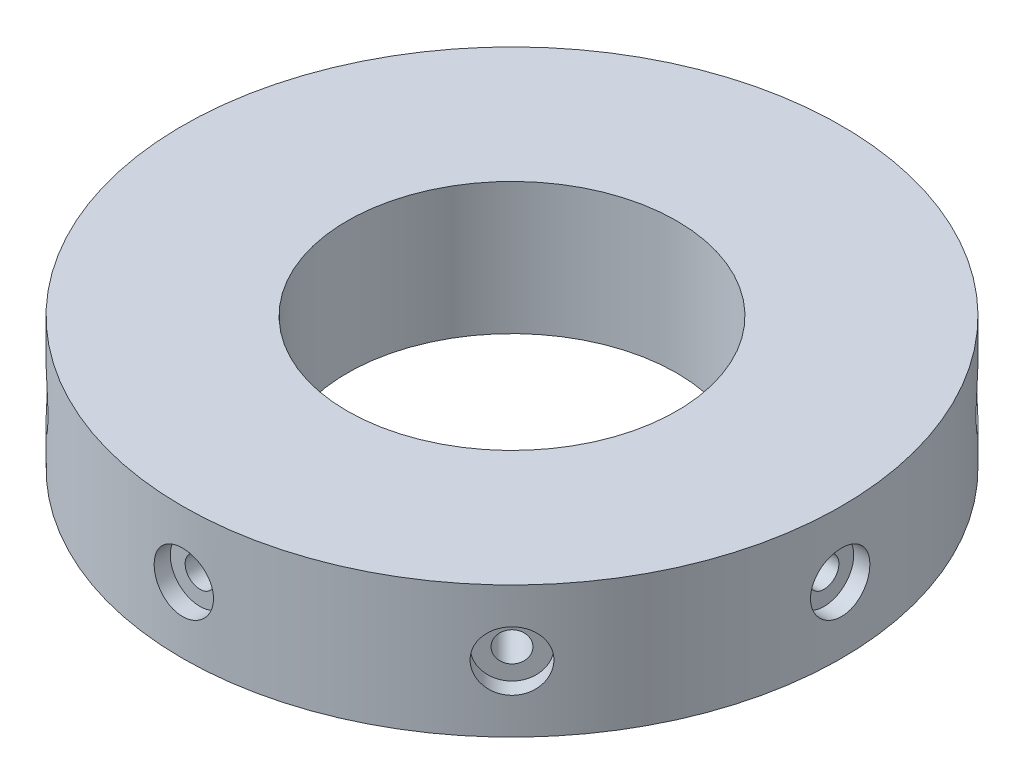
ISO-10303-21;
HEADER;
FILE_DESCRIPTION(('STEP AP214'),'2;1');
FILE_NAME('part.step','',(''),(''),'','','');
FILE_SCHEMA(('AUTOMOTIVE_DESIGN { 1 0 10303 214 1 1 1 1 }'));
ENDSEC;
DATA;
#1=APPLICATION_CONTEXT('core data for automotive mechanical design processes');
#2=APPLICATION_PROTOCOL_DEFINITION('international standard','automotive_design',2000,#1);
#3=PRODUCT_CONTEXT('',#1,'mechanical');
#4=PRODUCT('Part','Part','',(#3));
#5=PRODUCT_RELATED_PRODUCT_CATEGORY('part','',(#4));
#6=PRODUCT_DEFINITION_FORMATION('','',#4);
#7=PRODUCT_DEFINITION_CONTEXT('part definition',#1,'design');
#8=PRODUCT_DEFINITION('design','',#6,#7);
#9=PRODUCT_DEFINITION_SHAPE('','',#8);
#10=(LENGTH_UNIT() NAMED_UNIT(*) SI_UNIT(.MILLI.,.METRE.));
#11=(NAMED_UNIT(*) PLANE_ANGLE_UNIT() SI_UNIT($,.RADIAN.));
#12=(NAMED_UNIT(*) SI_UNIT($,.STERADIAN.) SOLID_ANGLE_UNIT());
#13=UNCERTAINTY_MEASURE_WITH_UNIT(LENGTH_MEASURE(1.E-05),#10,'distance_accuracy_value','');
#14=(GEOMETRIC_REPRESENTATION_CONTEXT(3) GLOBAL_UNCERTAINTY_ASSIGNED_CONTEXT((#13)) GLOBAL_UNIT_ASSIGNED_CONTEXT((#10,
#11,#12)) REPRESENTATION_CONTEXT('',''));
#15=CARTESIAN_POINT('',(0.,0.,0.));
#16=DIRECTION('',(0.,0.,1.));
#17=DIRECTION('',(1.,0.,0.));
#18=AXIS2_PLACEMENT_3D('',#15,#16,#17);
#19=CARTESIAN_POINT('',(0.,40.,0.));
#20=DIRECTION('',(0.,1.,0.));
#21=DIRECTION('',(0.,0.,1.));
#22=AXIS2_PLACEMENT_3D('',#19,#20,#21);
#23=PLANE('',#22);
#24=CARTESIAN_POINT('',(0.,40.,0.));
#25=DIRECTION('',(0.,1.,0.));
#26=DIRECTION('',(0.,0.,1.));
#27=AXIS2_PLACEMENT_3D('',#24,#25,#26);
#28=CIRCLE('',#27,100.);
#29=CARTESIAN_POINT('',(0.,40.,100.));
#30=VERTEX_POINT('',#29);
#31=EDGE_CURVE('E156',#30,#30,#28,.T.);
#32=ORIENTED_EDGE('',*,*,#31,.T.);
#33=EDGE_LOOP('',(#32));
#34=FACE_BOUND('',#33,.T.);
#35=CARTESIAN_POINT('',(0.,40.,0.));
#36=DIRECTION('',(0.,1.,0.));
#37=DIRECTION('',(0.,0.,1.));
#38=AXIS2_PLACEMENT_3D('',#35,#36,#37);
#39=CIRCLE('',#38,50.);
#40=CARTESIAN_POINT('',(0.,40.,50.));
#41=VERTEX_POINT('',#40);
#42=EDGE_CURVE('E150',#41,#41,#39,.T.);
#43=ORIENTED_EDGE('',*,*,#42,.F.);
#44=EDGE_LOOP('',(#43));
#45=FACE_BOUND('',#44,.T.);
#46=ADVANCED_FACE('F32',(#34,#45),#23,.T.);
#47=CARTESIAN_POINT('',(0.,0.,0.));
#48=DIRECTION('',(0.,1.,0.));
#49=DIRECTION('',(0.,0.,1.));
#50=AXIS2_PLACEMENT_3D('',#47,#48,#49);
#51=PLANE('',#50);
#52=CARTESIAN_POINT('',(0.,0.,0.));
#53=DIRECTION('',(0.,1.,0.));
#54=DIRECTION('',(0.,0.,1.));
#55=AXIS2_PLACEMENT_3D('',#52,#53,#54);
#56=CIRCLE('',#55,100.);
#57=CARTESIAN_POINT('',(0.,0.,100.));
#58=VERTEX_POINT('',#57);
#59=EDGE_CURVE('E153',#58,#58,#56,.T.);
#60=ORIENTED_EDGE('',*,*,#59,.F.);
#61=EDGE_LOOP('',(#60));
#62=FACE_BOUND('',#61,.T.);
#63=CARTESIAN_POINT('',(0.,0.,0.));
#64=DIRECTION('',(0.,1.,0.));
#65=DIRECTION('',(0.,0.,1.));
#66=AXIS2_PLACEMENT_3D('',#63,#64,#65);
#67=CIRCLE('',#66,50.);
#68=CARTESIAN_POINT('',(0.,0.,50.));
#69=VERTEX_POINT('',#68);
#70=EDGE_CURVE('E149',#69,#69,#67,.T.);
#71=ORIENTED_EDGE('',*,*,#70,.T.);
#72=EDGE_LOOP('',(#71));
#73=FACE_BOUND('',#72,.T.);
#74=ADVANCED_FACE('F197',(#62,#73),#51,.F.);
#75=CARTESIAN_POINT('',(0.,40.,0.));
#76=DIRECTION('',(0.,-1.,0.));
#77=DIRECTION('',(0.,0.,-1.));
#78=AXIS2_PLACEMENT_3D('',#75,#76,#77);
#79=CYLINDRICAL_SURFACE('',#78,100.);
#80=CARTESIAN_POINT('',(-64.0555159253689,20.,76.7912161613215));
#81=CARTESIAN_POINT('',(-64.0555138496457,19.7475397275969,76.7912174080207));
#82=CARTESIAN_POINT('',(-64.0637057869,19.4951157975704,76.7843866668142));
#83=CARTESIAN_POINT('',(-64.0963982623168,18.9919856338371,76.7570987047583));
#84=CARTESIAN_POINT('',(-64.1209027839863,18.7412798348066,76.7366381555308));
#85=CARTESIAN_POINT('',(-64.186037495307,18.243210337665,76.6821647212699));
#86=CARTESIAN_POINT('',(-64.2266836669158,17.9958502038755,76.6481384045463));
#87=CARTESIAN_POINT('',(-64.3237349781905,17.506476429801,76.5667103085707));
#88=CARTESIAN_POINT('',(-64.3801403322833,17.2644628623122,76.5193083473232));
#89=CARTESIAN_POINT('',(-64.5081672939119,16.7876467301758,76.4114085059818));
#90=CARTESIAN_POINT('',(-64.5797797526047,16.5528399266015,76.3509184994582));
#91=CARTESIAN_POINT('',(-64.7376095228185,16.0919385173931,76.2171411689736));
#92=CARTESIAN_POINT('',(-64.8238270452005,15.8658440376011,76.1438536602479));
#93=CARTESIAN_POINT('',(-65.0100771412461,15.4240473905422,75.9848987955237));
#94=CARTESIAN_POINT('',(-65.1101042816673,15.2083411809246,75.899236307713));
#95=CARTESIAN_POINT('',(-65.3231754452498,14.7886642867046,75.7159329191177));
#96=CARTESIAN_POINT('',(-65.4362239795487,14.584697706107,75.6182878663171));
#97=CARTESIAN_POINT('',(-65.6746441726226,14.1895207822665,75.4113127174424));
#98=CARTESIAN_POINT('',(-65.8000455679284,13.9983431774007,75.3019543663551));
#99=CARTESIAN_POINT('',(-66.0618817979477,13.6306412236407,75.0723523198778));
#100=CARTESIAN_POINT('',(-66.1983166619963,13.4541169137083,74.9521085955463));
#101=CARTESIAN_POINT('',(-66.4810919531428,13.1169598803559,74.7014063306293));
#102=CARTESIAN_POINT('',(-66.6274326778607,12.9563276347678,74.5709474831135));
#103=CARTESIAN_POINT('',(-66.9288226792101,12.6520914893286,74.3005630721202));
#104=CARTESIAN_POINT('',(-67.0838721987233,12.5084880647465,74.1606372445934));
#105=CARTESIAN_POINT('',(-67.4016946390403,12.2391053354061,73.8719007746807));
#106=CARTESIAN_POINT('',(-67.5644802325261,12.1133567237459,73.7230754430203));
#107=CARTESIAN_POINT('',(-67.8962251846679,11.8808780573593,73.4176642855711));
#108=CARTESIAN_POINT('',(-68.0651843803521,11.7741475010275,73.2610786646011));
#109=CARTESIAN_POINT('',(-68.4079493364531,11.5804705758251,72.9411230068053));
#110=CARTESIAN_POINT('',(-68.5817550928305,11.4935241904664,72.7777529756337));
#111=CARTESIAN_POINT('',(-68.932862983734,11.3400470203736,72.4452817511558));
#112=CARTESIAN_POINT('',(-69.1101651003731,11.2735161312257,72.2761805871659));
#113=CARTESIAN_POINT('',(-69.4664551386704,11.161498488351,71.9338063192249));
#114=CARTESIAN_POINT('',(-69.6454375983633,11.1159584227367,71.7605449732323));
#115=CARTESIAN_POINT('',(-70.0041314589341,11.046017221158,71.410673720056));
#116=CARTESIAN_POINT('',(-70.1838425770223,11.0216085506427,71.2340650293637));
#117=CARTESIAN_POINT('',(-70.5427683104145,10.9940790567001,70.8786402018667));
#118=CARTESIAN_POINT('',(-70.7219828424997,10.9909616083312,70.6998237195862));
#119=CARTESIAN_POINT('',(-71.0786001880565,11.0060463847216,70.3412860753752));
#120=CARTESIAN_POINT('',(-71.2560030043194,11.0242485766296,70.161564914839));
#121=CARTESIAN_POINT('',(-71.6072107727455,11.0817503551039,69.8030811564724));
#122=CARTESIAN_POINT('',(-71.7810251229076,11.1209847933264,69.6243173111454));
#123=CARTESIAN_POINT('',(-72.1244965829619,11.2202420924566,69.2684500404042));
#124=CARTESIAN_POINT('',(-72.2941522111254,11.2802722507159,69.0913472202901));
#125=CARTESIAN_POINT('',(-72.6280901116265,11.4206712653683,68.7402300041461));
#126=CARTESIAN_POINT('',(-72.7923733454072,11.5010364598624,68.5662150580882));
#127=CARTESIAN_POINT('',(-73.1145464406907,11.6815351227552,68.2225664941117));
#128=CARTESIAN_POINT('',(-73.2724361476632,11.7816690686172,68.0529329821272));
#129=CARTESIAN_POINT('',(-73.5810500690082,12.0011434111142,67.7191318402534));
#130=CARTESIAN_POINT('',(-73.7317638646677,12.1205106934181,67.5549722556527));
#131=CARTESIAN_POINT('',(-74.0248742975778,12.3775037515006,67.2336618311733));
#132=CARTESIAN_POINT('',(-74.1672707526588,12.5151299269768,67.0765111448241));
#133=CARTESIAN_POINT('',(-74.442902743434,12.8076664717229,66.7704773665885));
#134=CARTESIAN_POINT('',(-74.5761381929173,12.9625770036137,66.6215943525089));
#135=CARTESIAN_POINT('',(-74.8326800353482,13.2885909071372,66.3333041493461));
#136=CARTESIAN_POINT('',(-74.9559864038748,13.4596943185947,66.1938969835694));
#137=CARTESIAN_POINT('',(-75.1923979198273,13.8175311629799,65.925226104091));
#138=CARTESIAN_POINT('',(-75.3054651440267,14.0043181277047,65.79600031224));
#139=CARTESIAN_POINT('',(-75.5202728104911,14.391671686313,65.5493337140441));
#140=CARTESIAN_POINT('',(-75.6220134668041,14.5922380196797,65.4318926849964));
#141=CARTESIAN_POINT('',(-75.8136190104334,15.005745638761,65.2097898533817));
#142=CARTESIAN_POINT('',(-75.9034836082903,15.21868722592,65.1051283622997));
#143=CARTESIAN_POINT('',(-76.0708495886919,15.6554334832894,64.9094940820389));
#144=CARTESIAN_POINT('',(-76.1483512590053,15.8792379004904,64.8185209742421));
#145=CARTESIAN_POINT('',(-76.290606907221,16.3362110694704,64.6510276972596));
#146=CARTESIAN_POINT('',(-76.3553564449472,16.5693830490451,64.5745125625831));
#147=CARTESIAN_POINT('',(-76.4717117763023,17.0432779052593,64.4366777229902));
#148=CARTESIAN_POINT('',(-76.5233222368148,17.283998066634,64.3753526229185));
#149=CARTESIAN_POINT('',(-76.6131657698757,17.7713918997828,64.2684037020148));
#150=CARTESIAN_POINT('',(-76.6513967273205,18.0180665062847,64.2227823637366));
#151=CARTESIAN_POINT('',(-76.7142697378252,18.5155679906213,64.1476673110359));
#152=CARTESIAN_POINT('',(-76.7389118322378,18.7663948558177,64.1181735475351));
#153=CARTESIAN_POINT('',(-76.774412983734,19.2694724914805,64.0756605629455));
#154=CARTESIAN_POINT('',(-76.7853225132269,19.5217146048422,64.062581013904));
#155=CARTESIAN_POINT('',(-76.7934700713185,20.0268256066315,64.0528141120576));
#156=CARTESIAN_POINT('',(-76.7907032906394,20.2796946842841,64.0561325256));
#157=CARTESIAN_POINT('',(-76.7715033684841,20.7841158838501,64.0791424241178));
#158=CARTESIAN_POINT('',(-76.7550729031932,21.0356682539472,64.0988307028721));
#159=CARTESIAN_POINT('',(-76.7086338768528,21.5357168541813,64.1543981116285));
#160=CARTESIAN_POINT('',(-76.6786250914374,21.7842130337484,64.1902775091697));
#161=CARTESIAN_POINT('',(-76.6052481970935,22.2759546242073,64.2778282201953));
#162=CARTESIAN_POINT('',(-76.5619030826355,22.51920830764,64.3294723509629));
#163=CARTESIAN_POINT('',(-76.4620601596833,22.9991898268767,64.4481137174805));
#164=CARTESIAN_POINT('',(-76.4055620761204,23.2359175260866,64.5151112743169));
#165=CARTESIAN_POINT('',(-76.2797176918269,23.7011377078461,64.6638550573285));
#166=CARTESIAN_POINT('',(-76.2103734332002,23.9296314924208,64.7455989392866));
#167=CARTESIAN_POINT('',(-76.0591689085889,24.3768940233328,64.9231578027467));
#168=CARTESIAN_POINT('',(-75.9773045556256,24.5956595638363,65.0189773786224));
#169=CARTESIAN_POINT('',(-75.8012792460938,25.0224115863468,65.2241088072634));
#170=CARTESIAN_POINT('',(-75.7070867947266,25.2303684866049,65.3334551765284));
#171=CARTESIAN_POINT('',(-75.5070772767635,25.6334290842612,65.564507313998));
#172=CARTESIAN_POINT('',(-75.4012601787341,25.8285327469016,65.6862131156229));
#173=CARTESIAN_POINT('',(-75.1785584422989,26.2045521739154,65.9409809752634));
#174=CARTESIAN_POINT('',(-75.0616718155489,26.3854653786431,66.0740450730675));
#175=CARTESIAN_POINT('',(-74.8175366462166,26.7317381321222,66.3503592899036));
#176=CARTESIAN_POINT('',(-74.6902914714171,26.8971026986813,66.4936060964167));
#177=CARTESIAN_POINT('',(-74.4257205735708,27.2116663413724,66.789607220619));
#178=CARTESIAN_POINT('',(-74.2883649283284,27.3608139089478,66.9423895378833));
#179=CARTESIAN_POINT('',(-74.0047295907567,27.6412912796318,67.2558150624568));
#180=CARTESIAN_POINT('',(-73.8584500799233,27.7726214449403,67.4164581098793));
#181=CARTESIAN_POINT('',(-73.5578437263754,28.0165300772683,67.7443214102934));
#182=CARTESIAN_POINT('',(-73.4035167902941,28.1291083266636,67.9115417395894));
#183=CARTESIAN_POINT('',(-73.087777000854,28.3346990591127,68.2512315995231));
#184=CARTESIAN_POINT('',(-72.9263642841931,28.4277119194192,68.4237010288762));
#185=CARTESIAN_POINT('',(-72.5976919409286,28.5933944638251,68.7723231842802));
#186=CARTESIAN_POINT('',(-72.4304400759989,28.6660900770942,68.9484709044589));
#187=CARTESIAN_POINT('',(-72.0910513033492,28.7907456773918,69.3032507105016));
#188=CARTESIAN_POINT('',(-71.9189161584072,28.8427130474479,69.4818818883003));
#189=CARTESIAN_POINT('',(-71.570836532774,28.9255762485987,69.8403735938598));
#190=CARTESIAN_POINT('',(-71.3948914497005,28.9564687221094,70.020234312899));
#191=CARTESIAN_POINT('',(-71.0404372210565,28.9969422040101,70.3798267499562));
#192=CARTESIAN_POINT('',(-70.861928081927,29.0065232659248,70.559558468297));
#193=CARTESIAN_POINT('',(-70.5042793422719,29.0043079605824,70.916925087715));
#194=CARTESIAN_POINT('',(-70.3251445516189,28.9925909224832,71.0945652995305));
#195=CARTESIAN_POINT('',(-69.9668153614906,28.9480116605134,71.4472390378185));
#196=CARTESIAN_POINT('',(-69.7876209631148,28.9151420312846,71.6222716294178));
#197=CARTESIAN_POINT('',(-69.4305877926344,28.828498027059,71.9684326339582));
#198=CARTESIAN_POINT('',(-69.2527487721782,28.7747275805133,72.1395617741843));
#199=CARTESIAN_POINT('',(-68.8997201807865,28.6466699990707,72.4768111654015));
#200=CARTESIAN_POINT('',(-68.7245306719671,28.5723823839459,72.64293129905));
#201=CARTESIAN_POINT('',(-68.3781568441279,28.4038352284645,72.9690636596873));
#202=CARTESIAN_POINT('',(-68.2069721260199,28.3095776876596,73.1290764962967));
#203=CARTESIAN_POINT('',(-67.8699128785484,28.1017617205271,73.442003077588));
#204=CARTESIAN_POINT('',(-67.7040383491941,27.9882032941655,73.5949168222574));
#205=CARTESIAN_POINT('',(-67.3789008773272,27.742594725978,73.892708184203));
#206=CARTESIAN_POINT('',(-67.2196378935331,27.6105446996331,74.0375858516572));
#207=CARTESIAN_POINT('',(-66.9089911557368,27.328889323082,74.3184415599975));
#208=CARTESIAN_POINT('',(-66.7576072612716,27.1792842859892,74.4544197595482));
#209=CARTESIAN_POINT('',(-66.463409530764,26.8630042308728,74.7171616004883));
#210=CARTESIAN_POINT('',(-66.3206282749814,26.6962700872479,74.8438905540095));
#211=CARTESIAN_POINT('',(-66.0454483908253,26.3474148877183,75.0868326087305));
#212=CARTESIAN_POINT('',(-65.9130462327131,26.1652991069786,75.2030492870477));
#213=CARTESIAN_POINT('',(-65.6596206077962,25.7868323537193,75.4244161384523));
#214=CARTESIAN_POINT('',(-65.538601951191,25.5904754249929,75.5295616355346));
#215=CARTESIAN_POINT('',(-65.3090322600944,25.1849783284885,75.7281542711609));
#216=CARTESIAN_POINT('',(-65.2004810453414,24.9758383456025,75.8216015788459));
#217=CARTESIAN_POINT('',(-64.9965570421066,24.5457824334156,75.9964845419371));
#218=CARTESIAN_POINT('',(-64.9012130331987,24.3248421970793,76.0778939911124));
#219=CARTESIAN_POINT('',(-64.7248144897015,23.8731685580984,76.2280250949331));
#220=CARTESIAN_POINT('',(-64.6437597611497,23.6424352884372,76.2967469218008));
#221=CARTESIAN_POINT('',(-64.4967297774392,23.1730438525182,76.4210777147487));
#222=CARTESIAN_POINT('',(-64.4307393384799,22.9343939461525,76.4766998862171));
#223=CARTESIAN_POINT('',(-64.3143391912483,22.450731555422,76.5746142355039));
#224=CARTESIAN_POINT('',(-64.2639256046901,22.2057206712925,76.6169097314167));
#225=CARTESIAN_POINT('',(-64.1664750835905,21.6372632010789,76.6985575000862));
#226=CARTESIAN_POINT('',(-64.1249148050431,21.3121875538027,76.7332821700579));
#227=CARTESIAN_POINT('',(-64.0694366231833,20.6580540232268,76.7796106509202));
#228=CARTESIAN_POINT('',(-64.0555186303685,20.3289961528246,76.791214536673));
#229=CARTESIAN_POINT('',(-64.0555159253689,20.,76.7912161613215));
#230=B_SPLINE_CURVE_WITH_KNOTS('',3,(#80,#81,#82,#83,#84,#85,#86,#87,#88,#89,#90,#91,#92,#93,
#94,#95,#96,#97,#98,#99,#100,#101,#102,#103,#104,#105,#106,#107,#108,#109,#110,#111,#112,#113,
#114,#115,#116,#117,#118,#119,#120,#121,#122,#123,#124,#125,#126,#127,#128,#129,#130,#131,#132,
#133,#134,#135,#136,#137,#138,#139,#140,#141,#142,#143,#144,#145,#146,#147,#148,#149,#150,#151,
#152,#153,#154,#155,#156,#157,#158,#159,#160,#161,#162,#163,#164,#165,#166,#167,#168,#169,#170,
#171,#172,#173,#174,#175,#176,#177,#178,#179,#180,#181,#182,#183,#184,#185,#186,#187,#188,#189,
#190,#191,#192,#193,#194,#195,#196,#197,#198,#199,#200,#201,#202,#203,#204,#205,#206,#207,#208,
#209,#210,#211,#212,#213,#214,#215,#216,#217,#218,#219,#220,#221,#222,#223,#224,#225,#226,#227,
#228,#229),.UNSPECIFIED.,.T.,.F.,(4,2,2,2,2,2,2,2,2,2,2,2,2,2,2,2,2,2,2,2,2,2,2,2,2,2,2,2,2,2,2,
2,2,2,2,2,2,2,2,2,2,2,2,2,2,2,2,2,2,2,2,2,2,2,2,2,2,2,2,2,2,2,2,2,2,2,2,2,2,2,2,2,2,2,4),(0.,
0.757093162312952,1.51437127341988,2.27240104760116,3.03044113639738,3.78802646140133,
4.54562272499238,5.30292176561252,6.06048395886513,6.81991656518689,7.5793511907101,
8.33880864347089,9.09828728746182,9.85905609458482,10.6198048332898,11.3805529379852,
12.1412971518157,12.9000984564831,13.6586290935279,14.4172799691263,15.1759296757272,
15.9322428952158,16.6888217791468,17.4452645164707,18.2017255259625,18.9592532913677,
19.7167976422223,20.4743491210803,21.2319024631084,21.9921557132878,22.7523945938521,
23.51265200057,24.2728917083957,25.0333956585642,25.7936291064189,26.5539826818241,
27.3143339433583,28.0718823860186,28.8296972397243,29.5873637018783,30.3450426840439,
31.1014225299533,31.8578181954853,32.6140937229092,33.3706166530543,34.1291114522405,
34.8876083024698,35.6462416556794,36.4046293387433,37.1653594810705,37.926074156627,
38.6867976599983,39.4475064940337,40.2072400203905,40.9667027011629,41.7262863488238,
42.4858680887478,43.2426264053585,43.9996498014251,44.7565309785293,45.5134298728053,
46.2702530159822,47.0270761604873,47.7838945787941,48.540699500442,49.3002105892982,
50.0594622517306,50.8190333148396,51.5785933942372,52.3397834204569,53.1009631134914,
53.8613721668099,54.6215917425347,55.6082085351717,56.594822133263),.UNSPECIFIED.);
#231=CARTESIAN_POINT('',(-64.0555159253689,20.,76.7912161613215));
#232=VERTEX_POINT('',#231);
#233=EDGE_CURVE('E11',#232,#232,#230,.T.);
#234=ORIENTED_EDGE('',*,*,#233,.T.);
#235=EDGE_LOOP('',(#234));
#236=FACE_BOUND('',#235,.T.);
#237=CARTESIAN_POINT('',(-99.5936793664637,20.,9.00550000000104));
#238=CARTESIAN_POINT('',(-99.5936787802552,19.7475397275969,9.00550234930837));
#239=CARTESIAN_POINT('',(-99.5946412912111,19.4951157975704,8.99487971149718));
#240=CARTESIAN_POINT('',(-99.5984628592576,18.9919856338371,8.95246713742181));
#241=CARTESIAN_POINT('',(-99.6013223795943,18.7412798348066,8.92067203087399));
#242=CARTESIAN_POINT('',(-99.6088610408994,18.243210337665,8.83609630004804));
#243=CARTESIAN_POINT('',(-99.6135419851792,17.9958502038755,8.78329487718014));
#244=CARTESIAN_POINT('',(-99.6245892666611,17.506476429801,8.65709087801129));
#245=CARTESIAN_POINT('',(-99.6309556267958,17.2644628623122,8.5836880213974));
#246=CARTESIAN_POINT('',(-99.6451876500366,16.7876467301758,8.41686257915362));
#247=CARTESIAN_POINT('',(-99.6530524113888,16.5528399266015,8.32345203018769));
#248=CARTESIAN_POINT('',(-99.6700600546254,16.0919385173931,8.11725467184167));
#249=CARTESIAN_POINT('',(-99.6792029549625,15.8658440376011,8.00446758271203));
#250=CARTESIAN_POINT('',(-99.698503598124,15.4240473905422,7.76037081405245));
#251=CARTESIAN_POINT('',(-99.7086609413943,15.2083411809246,7.62906841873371));
#252=CARTESIAN_POINT('',(-99.7297099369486,14.7886642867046,7.34878928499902));
#253=CARTESIAN_POINT('',(-99.7406018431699,14.584697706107,7.19980642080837));
#254=CARTESIAN_POINT('',(-99.7628368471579,14.1895207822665,6.88486435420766));
#255=CARTESIAN_POINT('',(-99.7741809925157,13.9983431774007,6.71886414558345));
#256=CARTESIAN_POINT('',(-99.7969740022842,13.6306412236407,6.37136480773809));
#257=CARTESIAN_POINT('',(-99.8084228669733,13.4541169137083,6.18986563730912));
#258=CARTESIAN_POINT('',(-99.8311019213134,13.1169598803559,5.81264003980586));
#259=CARTESIAN_POINT('',(-99.842332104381,12.9563276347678,5.61691318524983));
#260=CARTESIAN_POINT('',(-99.8642563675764,12.6520914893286,5.21260762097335));
#261=CARTESIAN_POINT('',(-99.8749504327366,12.5084880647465,5.00402855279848));
#262=CARTESIAN_POINT('',(-99.8955173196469,12.2391053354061,4.57512663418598));
#263=CARTESIAN_POINT('',(-99.9053887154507,12.1133567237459,4.35478443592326));
#264=CARTESIAN_POINT('',(-99.9240095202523,11.8808780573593,3.90424703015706));
#265=CARTESIAN_POINT('',(-99.9327589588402,11.7741475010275,3.67405208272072));
#266=CARTESIAN_POINT('',(-99.9488875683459,11.5804705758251,3.20543784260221));
#267=CARTESIAN_POINT('',(-99.9562667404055,11.4935241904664,2.96701855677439));
#268=CARTESIAN_POINT('',(-99.9694448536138,11.3400470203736,2.48365512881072));
#269=CARTESIAN_POINT('',(-99.9752438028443,11.2735161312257,2.23871102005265));
#270=CARTESIAN_POINT('',(-99.9850837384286,11.161498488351,1.74468075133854));
#271=CARTESIAN_POINT('',(-99.9891291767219,11.1159584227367,1.49560676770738));
#272=CARTESIAN_POINT('',(-99.9953677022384,11.046017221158,0.994575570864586));
#273=CARTESIAN_POINT('',(-99.9975614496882,11.0216085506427,0.742619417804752));
#274=CARTESIAN_POINT('',(-100.000036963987,10.9940790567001,0.237497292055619));
#275=CARTESIAN_POINT('',(-100.000318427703,10.9909616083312,-0.0156688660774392));
#276=CARTESIAN_POINT('',(-99.9989605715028,11.0060463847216,-0.521359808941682));
#277=CARTESIAN_POINT('',(-99.9973212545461,11.0242485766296,-0.773884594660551));
#278=CARTESIAN_POINT('',(-99.9921763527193,11.0817503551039,-1.27571228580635));
#279=CARTESIAN_POINT('',(-99.9886765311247,11.1209847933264,-1.52502271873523));
#280=CARTESIAN_POINT('',(-99.9799113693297,11.2202420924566,-2.01952987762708));
#281=CARTESIAN_POINT('',(-99.9746454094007,11.2802722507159,-2.26472512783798));
#282=CARTESIAN_POINT('',(-99.9624977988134,11.4206712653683,-2.74913224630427));
#283=CARTESIAN_POINT('',(-99.9556164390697,11.5010364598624,-2.98834518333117));
#284=CARTESIAN_POINT('',(-99.9404309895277,11.6815351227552,-3.45915219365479));
#285=CARTESIAN_POINT('',(-99.9321268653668,11.7816690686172,-3.69074608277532));
#286=CARTESIAN_POINT('',(-99.9143168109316,12.0011434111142,-4.14500213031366));
#287=CARTESIAN_POINT('',(-99.9048092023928,12.1205106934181,-4.36765123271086));
#288=CARTESIAN_POINT('',(-99.8848687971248,12.3775037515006,-4.80211238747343));
#289=CARTESIAN_POINT('',(-99.8744359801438,12.5151299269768,-5.01392420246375));
#290=CARTESIAN_POINT('',(-99.8529386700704,12.8076664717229,-5.42522401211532));
#291=CARTESIAN_POINT('',(-99.8418741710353,12.9625770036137,-5.62471189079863));
#292=CARTESIAN_POINT('',(-99.8194246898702,13.2885909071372,-6.00996632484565));
#293=CARTESIAN_POINT('',(-99.8080397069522,13.4596943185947,-6.19573284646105));
#294=CARTESIAN_POINT('',(-99.7852288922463,13.8175311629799,-6.55288003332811));
#295=CARTESIAN_POINT('',(-99.7738030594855,14.0043181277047,-6.72420706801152));
#296=CARTESIAN_POINT('',(-99.7512753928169,14.391671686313,-7.05051864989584));
#297=CARTESIAN_POINT('',(-99.740173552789,14.5922380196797,-7.20550350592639));
#298=CARTESIAN_POINT('',(-99.7186087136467,15.005745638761,-7.49803950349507));
#299=CARTESIAN_POINT('',(-99.7081457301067,15.21868722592,-7.63559022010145));
#300=CARTESIAN_POINT('',(-99.6881570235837,15.6554334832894,-7.89227016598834));
#301=CARTESIAN_POINT('',(-99.6786312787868,15.8792379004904,-8.01139982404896));
#302=CARTESIAN_POINT('',(-99.6607855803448,16.3362110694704,-8.23042538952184));
#303=CARTESIAN_POINT('',(-99.6524660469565,16.5693830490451,-8.33031459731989));
#304=CARTESIAN_POINT('',(-99.6372777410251,17.0432779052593,-8.51005419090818));
#305=CARTESIAN_POINT('',(-99.6304084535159,17.283998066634,-8.58991169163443));
#306=CARTESIAN_POINT('',(-99.6183131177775,17.7713918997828,-8.72906497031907));
#307=CARTESIAN_POINT('',(-99.6130873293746,18.0180665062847,-8.78835749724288));
#308=CARTESIAN_POINT('',(-99.6044308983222,18.5155679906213,-8.88592979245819));
#309=CARTESIAN_POINT('',(-99.6010002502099,18.7663948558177,-8.92420962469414));
#310=CARTESIAN_POINT('',(-99.596042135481,19.2694724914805,-8.97937394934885));
#311=CARTESIAN_POINT('',(-99.5945076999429,19.5217146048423,-8.99633678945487));
#312=CARTESIAN_POINT('',(-99.5933626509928,20.0268256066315,-9.0090042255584));
#313=CARTESIAN_POINT('',(-99.5937527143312,20.2796946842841,-9.0047013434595));
#314=CARTESIAN_POINT('',(-99.5964467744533,20.7841158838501,-8.97485449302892));
#315=CARTESIAN_POINT('',(-99.5987503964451,21.0356682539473,-8.94931468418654));
#316=CARTESIAN_POINT('',(-99.6052051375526,21.5357168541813,-8.87718524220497));
#317=CARTESIAN_POINT('',(-99.6093562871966,21.7842130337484,-8.83059526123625));
#318=CARTESIAN_POINT('',(-99.6193786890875,22.2759546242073,-8.71680226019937));
#319=CARTESIAN_POINT('',(-99.6252469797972,22.51920830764,-8.6496347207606));
#320=CARTESIAN_POINT('',(-99.638539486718,22.9991898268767,-8.49514299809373));
#321=CARTESIAN_POINT('',(-99.6459637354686,23.2359175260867,-8.40781839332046));
#322=CARTESIAN_POINT('',(-99.6621560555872,23.7011377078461,-8.21365523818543));
#323=CARTESIAN_POINT('',(-99.670923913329,23.9296314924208,-8.106819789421));
#324=CARTESIAN_POINT('',(-99.6895592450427,24.3768940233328,-7.87434896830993));
#325=CARTESIAN_POINT('',(-99.6994270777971,24.5956595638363,-7.74870745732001));
#326=CARTESIAN_POINT('',(-99.7200082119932,25.0224115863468,-7.47918894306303));
#327=CARTESIAN_POINT('',(-99.7307236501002,25.2303684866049,-7.33526526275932));
#328=CARTESIAN_POINT('',(-99.7526740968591,25.6334290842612,-7.03045864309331));
#329=CARTESIAN_POINT('',(-99.7639091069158,25.8285327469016,-6.8695756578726));
#330=CARTESIAN_POINT('',(-99.7865832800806,26.2045521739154,-6.531953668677));
#331=CARTESIAN_POINT('',(-99.7980224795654,26.3854653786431,-6.35521181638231));
#332=CARTESIAN_POINT('',(-99.8207765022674,26.7317381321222,-5.98719852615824));
#333=CARTESIAN_POINT('',(-99.8320913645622,26.8971026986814,-5.79593181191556));
#334=CARTESIAN_POINT('',(-99.8543158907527,27.2116663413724,-5.39954753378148));
#335=CARTESIAN_POINT('',(-99.8652241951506,27.3608139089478,-5.19438901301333));
#336=CARTESIAN_POINT('',(-99.8862890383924,27.6412912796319,-4.77220322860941));
#337=CARTESIAN_POINT('',(-99.8964455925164,27.7726214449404,-4.55517620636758));
#338=CARTESIAN_POINT('',(-99.9157191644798,28.0165300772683,-4.11078105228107));
#339=CARTESIAN_POINT('',(-99.9248361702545,28.1291083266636,-3.88341280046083));
#340=CARTESIAN_POINT('',(-99.9417714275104,28.3346990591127,-3.41995405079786));
#341=CARTESIAN_POINT('',(-99.9495897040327,28.4277119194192,-3.18386372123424));
#342=CARTESIAN_POINT('',(-99.9636963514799,28.5933944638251,-2.70494418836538));
#343=CARTESIAN_POINT('',(-99.9699866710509,28.6660900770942,-2.46212401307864));
#344=CARTESIAN_POINT('',(-99.9808697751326,28.7907456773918,-1.97127270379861));
#345=CARTESIAN_POINT('',(-99.9854631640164,28.8427130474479,-1.72324345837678));
#346=CARTESIAN_POINT('',(-99.9928256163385,28.9255762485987,-1.22362207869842));
#347=CARTESIAN_POINT('',(-99.9955943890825,28.9564687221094,-0.972029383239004));
#348=CARTESIAN_POINT('',(-99.9992276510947,28.9969422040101,-0.467122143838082));
#349=CARTESIAN_POINT('',(-100.000092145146,29.0065232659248,-0.213807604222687));
#350=CARTESIAN_POINT('',(-99.9998926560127,29.0043079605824,0.291784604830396));
#351=CARTESIAN_POINT('',(-99.9988358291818,28.9925909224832,0.544062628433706));
#352=CARTESIAN_POINT('',(-99.9948368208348,28.9480116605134,1.04681762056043));
#353=CARTESIAN_POINT('',(-99.9918939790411,28.9151420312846,1.29729392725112));
#354=CARTESIAN_POINT('',(-99.9842061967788,28.828498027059,1.79452729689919));
#355=CARTESIAN_POINT('',(-99.9794615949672,28.7747275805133,2.04128504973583));
#356=CARTESIAN_POINT('',(-99.9683040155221,28.6466699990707,2.52938529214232));
#357=CARTESIAN_POINT('',(-99.9618909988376,28.5723823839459,2.77072765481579));
#358=CARTESIAN_POINT('',(-99.9475781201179,28.4038352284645,3.24626134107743));
#359=CARTESIAN_POINT('',(-99.9396784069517,28.3095776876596,3.48045337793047));
#360=CARTESIAN_POINT('',(-99.9226140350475,28.1017617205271,3.94006276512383));
#361=CARTESIAN_POINT('',(-99.9134493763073,27.9882032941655,4.16548011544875));
#362=CARTESIAN_POINT('',(-99.8941127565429,27.742594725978,4.60595731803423));
#363=CARTESIAN_POINT('',(-99.8839408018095,27.6105446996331,4.82101723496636));
#364=CARTESIAN_POINT('',(-99.8628753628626,27.328889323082,5.23927262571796));
#365=CARTESIAN_POINT('',(-99.8519818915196,27.1792842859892,5.4424683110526));
#366=CARTESIAN_POINT('',(-99.8297392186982,26.8630042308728,5.83628405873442));
#367=CARTESIAN_POINT('',(-99.8183885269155,26.6962700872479,6.0268565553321));
#368=CARTESIAN_POINT('',(-99.7955929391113,26.3474148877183,6.39322409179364));
#369=CARTESIAN_POINT('',(-99.7841480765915,26.1652991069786,6.56902415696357));
#370=CARTESIAN_POINT('',(-99.7614791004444,25.7868323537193,6.90475313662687));
#371=CARTESIAN_POINT('',(-99.7502550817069,25.5904754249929,7.06467534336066));
#372=CARTESIAN_POINT('',(-99.7283509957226,25.1849783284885,7.36743182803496));
#373=CARTESIAN_POINT('',(-99.7176709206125,24.9758383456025,7.51026635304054));
#374=CARTESIAN_POINT('',(-99.6971358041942,24.5457824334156,7.77812332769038));
#375=CARTESIAN_POINT('',(-99.6872825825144,24.3248421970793,7.90310689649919));
#376=CARTESIAN_POINT('',(-99.6687086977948,23.8731685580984,8.13399822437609));
#377=CARTESIAN_POINT('',(-99.6599880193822,23.6424352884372,8.23990624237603));
#378=CARTESIAN_POINT('',(-99.6439372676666,23.1730438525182,8.43178728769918));
#379=CARTESIAN_POINT('',(-99.6366057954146,22.9343939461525,8.51778038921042));
#380=CARTESIAN_POINT('',(-99.6235343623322,22.450731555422,8.66932362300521));
#381=CARTESIAN_POINT('',(-99.6177940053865,22.2057206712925,8.73487884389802));
#382=CARTESIAN_POINT('',(-99.6066197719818,21.6372632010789,8.86152045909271));
#383=CARTESIAN_POINT('',(-99.6017862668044,21.3121875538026,8.91546206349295));
#384=CARTESIAN_POINT('',(-99.5953164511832,20.6580540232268,8.98745024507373));
#385=CARTESIAN_POINT('',(-99.5936801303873,20.3289961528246,9.00549693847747));
#386=CARTESIAN_POINT('',(-99.5936793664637,20.,9.00550000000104));
#387=B_SPLINE_CURVE_WITH_KNOTS('',3,(#237,#238,#239,#240,#241,#242,#243,#244,#245,#246,#247,
#248,#249,#250,#251,#252,#253,#254,#255,#256,#257,#258,#259,#260,#261,#262,#263,#264,#265,#266,
#267,#268,#269,#270,#271,#272,#273,#274,#275,#276,#277,#278,#279,#280,#281,#282,#283,#284,#285,
#286,#287,#288,#289,#290,#291,#292,#293,#294,#295,#296,#297,#298,#299,#300,#301,#302,#303,#304,
#305,#306,#307,#308,#309,#310,#311,#312,#313,#314,#315,#316,#317,#318,#319,#320,#321,#322,#323,
#324,#325,#326,#327,#328,#329,#330,#331,#332,#333,#334,#335,#336,#337,#338,#339,#340,#341,#342,
#343,#344,#345,#346,#347,#348,#349,#350,#351,#352,#353,#354,#355,#356,#357,#358,#359,#360,#361,
#362,#363,#364,#365,#366,#367,#368,#369,#370,#371,#372,#373,#374,#375,#376,#377,#378,#379,#380,
#381,#382,#383,#384,#385,#386),.UNSPECIFIED.,.T.,.F.,(4,2,2,2,2,2,2,2,2,2,2,2,2,2,2,2,2,2,2,2,2,
2,2,2,2,2,2,2,2,2,2,2,2,2,2,2,2,2,2,2,2,2,2,2,2,2,2,2,2,2,2,2,2,2,2,2,2,2,2,2,2,2,2,2,2,2,2,2,2,
2,2,2,2,2,4),(0.,0.757093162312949,1.51437127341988,2.27240104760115,3.03044113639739,
3.78802646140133,4.54562272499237,5.30292176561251,6.06048395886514,6.81991656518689,
7.5793511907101,8.33880864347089,9.09828728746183,9.85905609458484,10.6198048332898,
11.3805529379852,12.1412971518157,12.9000984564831,13.6586290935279,14.4172799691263,
15.1759296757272,15.9322428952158,16.6888217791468,17.4452645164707,18.2017255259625,
18.9592532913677,19.7167976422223,20.4743491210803,21.2319024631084,21.9921557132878,
22.7523945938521,23.51265200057,24.2728917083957,25.0333956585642,25.7936291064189,
26.5539826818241,27.3143339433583,28.0718823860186,28.8296972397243,29.5873637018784,
30.345042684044,31.1014225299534,31.8578181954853,32.6140937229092,33.3706166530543,
34.1291114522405,34.8876083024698,35.6462416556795,36.4046293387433,37.1653594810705,
37.926074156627,38.6867976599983,39.4475064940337,40.2072400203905,40.9667027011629,
41.7262863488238,42.4858680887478,43.2426264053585,43.9996498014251,44.7565309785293,
45.5134298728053,46.2702530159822,47.0270761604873,47.7838945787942,48.540699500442,
49.3002105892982,50.0594622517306,50.8190333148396,51.5785933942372,52.3397834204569,
53.1009631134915,53.8613721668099,54.6215917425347,55.6082085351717,56.594822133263),.UNSPECIFIED.);
#388=CARTESIAN_POINT('',(-99.5936793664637,20.,9.00550000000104));
#389=VERTEX_POINT('',#388);
#390=EDGE_CURVE('E44',#389,#389,#387,.T.);
#391=ORIENTED_EDGE('',*,*,#390,.T.);
#392=EDGE_LOOP('',(#391));
#393=FACE_BOUND('',#392,.T.);
#394=CARTESIAN_POINT('',(-76.7912161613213,20.,-64.0555159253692));
#395=CARTESIAN_POINT('',(-76.7912174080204,19.7475397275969,-64.055513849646));
#396=CARTESIAN_POINT('',(-76.7843866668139,19.4951157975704,-64.0637057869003));
#397=CARTESIAN_POINT('',(-76.7570987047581,18.9919856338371,-64.096398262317));
#398=CARTESIAN_POINT('',(-76.7366381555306,18.7412798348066,-64.1209027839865));
#399=CARTESIAN_POINT('',(-76.6821647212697,18.243210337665,-64.1860374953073));
#400=CARTESIAN_POINT('',(-76.6481384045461,17.9958502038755,-64.2266836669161));
#401=CARTESIAN_POINT('',(-76.5667103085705,17.506476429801,-64.3237349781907));
#402=CARTESIAN_POINT('',(-76.519308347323,17.2644628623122,-64.3801403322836));
#403=CARTESIAN_POINT('',(-76.4114085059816,16.7876467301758,-64.5081672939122));
#404=CARTESIAN_POINT('',(-76.350918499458,16.5528399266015,-64.5797797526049));
#405=CARTESIAN_POINT('',(-76.2171411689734,16.0919385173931,-64.7376095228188));
#406=CARTESIAN_POINT('',(-76.1438536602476,15.8658440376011,-64.8238270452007));
#407=CARTESIAN_POINT('',(-75.9848987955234,15.4240473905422,-65.0100771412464));
#408=CARTESIAN_POINT('',(-75.8992363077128,15.2083411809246,-65.1101042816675));
#409=CARTESIAN_POINT('',(-75.7159329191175,14.7886642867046,-65.32317544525));
#410=CARTESIAN_POINT('',(-75.6182878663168,14.584697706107,-65.436223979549));
#411=CARTESIAN_POINT('',(-75.4113127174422,14.1895207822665,-65.6746441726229));
#412=CARTESIAN_POINT('',(-75.3019543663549,13.9983431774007,-65.8000455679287));
#413=CARTESIAN_POINT('',(-75.0723523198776,13.6306412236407,-66.061881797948));
#414=CARTESIAN_POINT('',(-74.9521085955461,13.4541169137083,-66.1983166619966));
#415=CARTESIAN_POINT('',(-74.7014063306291,13.1169598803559,-66.481091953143));
#416=CARTESIAN_POINT('',(-74.5709474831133,12.9563276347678,-66.627432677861));
#417=CARTESIAN_POINT('',(-74.30056307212,12.6520914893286,-66.9288226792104));
#418=CARTESIAN_POINT('',(-74.1606372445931,12.5084880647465,-67.0838721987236));
#419=CARTESIAN_POINT('',(-73.8719007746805,12.2391053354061,-67.4016946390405));
#420=CARTESIAN_POINT('',(-73.72307544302,12.1133567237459,-67.5644802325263));
#421=CARTESIAN_POINT('',(-73.4176642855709,11.8808780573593,-67.8962251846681));
#422=CARTESIAN_POINT('',(-73.2610786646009,11.7741475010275,-68.0651843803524));
#423=CARTESIAN_POINT('',(-72.9411230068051,11.5804705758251,-68.4079493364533));
#424=CARTESIAN_POINT('',(-72.7777529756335,11.4935241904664,-68.5817550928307));
#425=CARTESIAN_POINT('',(-72.4452817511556,11.3400470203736,-68.9328629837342));
#426=CARTESIAN_POINT('',(-72.2761805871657,11.2735161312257,-69.1101651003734));
#427=CARTESIAN_POINT('',(-71.9338063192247,11.161498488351,-69.4664551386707));
#428=CARTESIAN_POINT('',(-71.760544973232,11.1159584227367,-69.6454375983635));
#429=CARTESIAN_POINT('',(-71.4106737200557,11.046017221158,-70.0041314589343));
#430=CARTESIAN_POINT('',(-71.2340650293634,11.0216085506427,-70.1838425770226));
#431=CARTESIAN_POINT('',(-70.8786402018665,10.9940790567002,-70.5427683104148));
#432=CARTESIAN_POINT('',(-70.699823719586,10.9909616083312,-70.7219828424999));
#433=CARTESIAN_POINT('',(-70.3412860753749,11.0060463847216,-71.0786001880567));
#434=CARTESIAN_POINT('',(-70.1615649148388,11.0242485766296,-71.2560030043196));
#435=CARTESIAN_POINT('',(-69.8030811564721,11.0817503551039,-71.6072107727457));
#436=CARTESIAN_POINT('',(-69.6243173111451,11.1209847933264,-71.7810251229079));
#437=CARTESIAN_POINT('',(-69.268450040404,11.2202420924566,-72.1244965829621));
#438=CARTESIAN_POINT('',(-69.0913472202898,11.2802722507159,-72.2941522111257));
#439=CARTESIAN_POINT('',(-68.7402300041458,11.4206712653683,-72.6280901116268));
#440=CARTESIAN_POINT('',(-68.566215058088,11.5010364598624,-72.7923733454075));
#441=CARTESIAN_POINT('',(-68.2225664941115,11.6815351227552,-73.114546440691));
#442=CARTESIAN_POINT('',(-68.052932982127,11.7816690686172,-73.2724361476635));
#443=CARTESIAN_POINT('',(-67.7191318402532,12.0011434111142,-73.5810500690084));
#444=CARTESIAN_POINT('',(-67.5549722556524,12.1205106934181,-73.7317638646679));
#445=CARTESIAN_POINT('',(-67.233661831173,12.3775037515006,-74.024874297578));
#446=CARTESIAN_POINT('',(-67.0765111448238,12.5151299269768,-74.167270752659));
#447=CARTESIAN_POINT('',(-66.7704773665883,12.8076664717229,-74.4429027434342));
#448=CARTESIAN_POINT('',(-66.6215943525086,12.9625770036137,-74.5761381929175));
#449=CARTESIAN_POINT('',(-66.3333041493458,13.2885909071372,-74.8326800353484));
#450=CARTESIAN_POINT('',(-66.1938969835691,13.4596943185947,-74.955986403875));
#451=CARTESIAN_POINT('',(-65.9252261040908,13.8175311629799,-75.1923979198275));
#452=CARTESIAN_POINT('',(-65.7960003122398,14.0043181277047,-75.3054651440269));
#453=CARTESIAN_POINT('',(-65.5493337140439,14.391671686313,-75.5202728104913));
#454=CARTESIAN_POINT('',(-65.4318926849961,14.5922380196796,-75.6220134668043));
#455=CARTESIAN_POINT('',(-65.2097898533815,15.005745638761,-75.8136190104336));
#456=CARTESIAN_POINT('',(-65.1051283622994,15.21868722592,-75.9034836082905));
#457=CARTESIAN_POINT('',(-64.9094940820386,15.6554334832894,-76.0708495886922));
#458=CARTESIAN_POINT('',(-64.8185209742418,15.8792379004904,-76.1483512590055));
#459=CARTESIAN_POINT('',(-64.6510276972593,16.3362110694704,-76.2906069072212));
#460=CARTESIAN_POINT('',(-64.5745125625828,16.5693830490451,-76.3553564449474));
#461=CARTESIAN_POINT('',(-64.43667772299,17.0432779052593,-76.4717117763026));
#462=CARTESIAN_POINT('',(-64.3753526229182,17.283998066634,-76.5233222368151));
#463=CARTESIAN_POINT('',(-64.2684037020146,17.7713918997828,-76.6131657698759));
#464=CARTESIAN_POINT('',(-64.2227823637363,18.0180665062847,-76.6513967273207));
#465=CARTESIAN_POINT('',(-64.1476673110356,18.5155679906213,-76.7142697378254));
#466=CARTESIAN_POINT('',(-64.1181735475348,18.7663948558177,-76.738911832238));
#467=CARTESIAN_POINT('',(-64.0756605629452,19.2694724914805,-76.7744129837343));
#468=CARTESIAN_POINT('',(-64.0625810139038,19.5217146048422,-76.7853225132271));
#469=CARTESIAN_POINT('',(-64.0528141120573,20.0268256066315,-76.7934700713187));
#470=CARTESIAN_POINT('',(-64.0561325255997,20.2796946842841,-76.7907032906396));
#471=CARTESIAN_POINT('',(-64.0791424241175,20.7841158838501,-76.7715033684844));
#472=CARTESIAN_POINT('',(-64.0988307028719,21.0356682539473,-76.7550729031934));
#473=CARTESIAN_POINT('',(-64.1543981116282,21.5357168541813,-76.708633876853));
#474=CARTESIAN_POINT('',(-64.1902775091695,21.7842130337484,-76.6786250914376));
#475=CARTESIAN_POINT('',(-64.277828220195,22.2759546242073,-76.6052481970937));
#476=CARTESIAN_POINT('',(-64.3294723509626,22.51920830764,-76.5619030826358));
#477=CARTESIAN_POINT('',(-64.4481137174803,22.9991898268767,-76.4620601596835));
#478=CARTESIAN_POINT('',(-64.5151112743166,23.2359175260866,-76.4055620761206));
#479=CARTESIAN_POINT('',(-64.6638550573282,23.7011377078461,-76.2797176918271));
#480=CARTESIAN_POINT('',(-64.7455989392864,23.9296314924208,-76.2103734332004));
#481=CARTESIAN_POINT('',(-64.9231578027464,24.3768940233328,-76.0591689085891));
#482=CARTESIAN_POINT('',(-65.0189773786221,24.5956595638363,-75.9773045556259));
#483=CARTESIAN_POINT('',(-65.2241088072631,25.0224115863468,-75.801279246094));
#484=CARTESIAN_POINT('',(-65.3334551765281,25.2303684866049,-75.7070867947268));
#485=CARTESIAN_POINT('',(-65.5645073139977,25.6334290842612,-75.5070772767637));
#486=CARTESIAN_POINT('',(-65.6862131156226,25.8285327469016,-75.4012601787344));
#487=CARTESIAN_POINT('',(-65.9409809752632,26.2045521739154,-75.1785584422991));
#488=CARTESIAN_POINT('',(-66.0740450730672,26.3854653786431,-75.0616718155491));
#489=CARTESIAN_POINT('',(-66.3503592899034,26.7317381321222,-74.8175366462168));
#490=CARTESIAN_POINT('',(-66.4936060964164,26.8971026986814,-74.6902914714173));
#491=CARTESIAN_POINT('',(-66.7896072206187,27.2116663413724,-74.425720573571));
#492=CARTESIAN_POINT('',(-66.9423895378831,27.3608139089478,-74.2883649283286));
#493=CARTESIAN_POINT('',(-67.2558150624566,27.6412912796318,-74.004729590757));
#494=CARTESIAN_POINT('',(-67.416458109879,27.7726214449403,-73.8584500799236));
#495=CARTESIAN_POINT('',(-67.7443214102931,28.0165300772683,-73.5578437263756));
#496=CARTESIAN_POINT('',(-67.9115417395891,28.1291083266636,-73.4035167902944));
#497=CARTESIAN_POINT('',(-68.2512315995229,28.3346990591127,-73.0877770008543));
#498=CARTESIAN_POINT('',(-68.423701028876,28.4277119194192,-72.9263642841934));
#499=CARTESIAN_POINT('',(-68.7723231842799,28.5933944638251,-72.5976919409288));
#500=CARTESIAN_POINT('',(-68.9484709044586,28.6660900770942,-72.4304400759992));
#501=CARTESIAN_POINT('',(-69.3032507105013,28.7907456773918,-72.0910513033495));
#502=CARTESIAN_POINT('',(-69.4818818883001,28.8427130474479,-71.9189161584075));
#503=CARTESIAN_POINT('',(-69.8403735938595,28.9255762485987,-71.5708365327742));
#504=CARTESIAN_POINT('',(-70.0202343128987,28.9564687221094,-71.3948914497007));
#505=CARTESIAN_POINT('',(-70.3798267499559,28.9969422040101,-71.0404372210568));
#506=CARTESIAN_POINT('',(-70.5595584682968,29.0065232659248,-70.8619280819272));
#507=CARTESIAN_POINT('',(-70.9169250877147,29.0043079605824,-70.5042793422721));
#508=CARTESIAN_POINT('',(-71.0945652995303,28.9925909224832,-70.3251445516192));
#509=CARTESIAN_POINT('',(-71.4472390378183,28.9480116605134,-69.9668153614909));
#510=CARTESIAN_POINT('',(-71.6222716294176,28.9151420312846,-69.787620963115));
#511=CARTESIAN_POINT('',(-71.968432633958,28.828498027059,-69.4305877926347));
#512=CARTESIAN_POINT('',(-72.1395617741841,28.7747275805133,-69.2527487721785));
#513=CARTESIAN_POINT('',(-72.4768111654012,28.6466699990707,-68.8997201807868));
#514=CARTESIAN_POINT('',(-72.6429312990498,28.5723823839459,-68.7245306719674));
#515=CARTESIAN_POINT('',(-72.9690636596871,28.4038352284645,-68.3781568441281));
#516=CARTESIAN_POINT('',(-73.1290764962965,28.3095776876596,-68.2069721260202));
#517=CARTESIAN_POINT('',(-73.4420030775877,28.1017617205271,-67.8699128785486));
#518=CARTESIAN_POINT('',(-73.5949168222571,27.9882032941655,-67.7040383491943));
#519=CARTESIAN_POINT('',(-73.8927081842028,27.742594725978,-67.3789008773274));
#520=CARTESIAN_POINT('',(-74.037585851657,27.6105446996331,-67.2196378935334));
#521=CARTESIAN_POINT('',(-74.3184415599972,27.328889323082,-66.908991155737));
#522=CARTESIAN_POINT('',(-74.454419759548,27.1792842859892,-66.7576072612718));
#523=CARTESIAN_POINT('',(-74.7171616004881,26.8630042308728,-66.4634095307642));
#524=CARTESIAN_POINT('',(-74.8438905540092,26.6962700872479,-66.3206282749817));
#525=CARTESIAN_POINT('',(-75.0868326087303,26.3474148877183,-66.0454483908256));
#526=CARTESIAN_POINT('',(-75.2030492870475,26.1652991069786,-65.9130462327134));
#527=CARTESIAN_POINT('',(-75.4244161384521,25.7868323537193,-65.6596206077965));
#528=CARTESIAN_POINT('',(-75.5295616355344,25.5904754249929,-65.5386019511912));
#529=CARTESIAN_POINT('',(-75.7281542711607,25.1849783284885,-65.3090322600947));
#530=CARTESIAN_POINT('',(-75.8216015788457,24.9758383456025,-65.2004810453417));
#531=CARTESIAN_POINT('',(-75.9964845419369,24.5457824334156,-64.9965570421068));
#532=CARTESIAN_POINT('',(-76.0778939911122,24.3248421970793,-64.9012130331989));
#533=CARTESIAN_POINT('',(-76.2280250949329,23.8731685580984,-64.7248144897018));
#534=CARTESIAN_POINT('',(-76.2967469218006,23.6424352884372,-64.6437597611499));
#535=CARTESIAN_POINT('',(-76.4210777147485,23.1730438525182,-64.4967297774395));
#536=CARTESIAN_POINT('',(-76.4766998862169,22.9343939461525,-64.4307393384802));
#537=CARTESIAN_POINT('',(-76.5746142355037,22.450731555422,-64.3143391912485));
#538=CARTESIAN_POINT('',(-76.6169097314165,22.2057206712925,-64.2639256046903));
#539=CARTESIAN_POINT('',(-76.698557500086,21.6372632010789,-64.1664750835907));
#540=CARTESIAN_POINT('',(-76.7332821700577,21.3121875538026,-64.1249148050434));
#541=CARTESIAN_POINT('',(-76.77961065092,20.6580540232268,-64.0694366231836));
#542=CARTESIAN_POINT('',(-76.7912145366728,20.3289961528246,-64.0555186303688));
#543=CARTESIAN_POINT('',(-76.7912161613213,20.,-64.0555159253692));
#544=B_SPLINE_CURVE_WITH_KNOTS('',3,(#394,#395,#396,#397,#398,#399,#400,#401,#402,#403,#404,
#405,#406,#407,#408,#409,#410,#411,#412,#413,#414,#415,#416,#417,#418,#419,#420,#421,#422,#423,
#424,#425,#426,#427,#428,#429,#430,#431,#432,#433,#434,#435,#436,#437,#438,#439,#440,#441,#442,
#443,#444,#445,#446,#447,#448,#449,#450,#451,#452,#453,#454,#455,#456,#457,#458,#459,#460,#461,
#462,#463,#464,#465,#466,#467,#468,#469,#470,#471,#472,#473,#474,#475,#476,#477,#478,#479,#480,
#481,#482,#483,#484,#485,#486,#487,#488,#489,#490,#491,#492,#493,#494,#495,#496,#497,#498,#499,
#500,#501,#502,#503,#504,#505,#506,#507,#508,#509,#510,#511,#512,#513,#514,#515,#516,#517,#518,
#519,#520,#521,#522,#523,#524,#525,#526,#527,#528,#529,#530,#531,#532,#533,#534,#535,#536,#537,
#538,#539,#540,#541,#542,#543),.UNSPECIFIED.,.T.,.F.,(4,2,2,2,2,2,2,2,2,2,2,2,2,2,2,2,2,2,2,2,2,
2,2,2,2,2,2,2,2,2,2,2,2,2,2,2,2,2,2,2,2,2,2,2,2,2,2,2,2,2,2,2,2,2,2,2,2,2,2,2,2,2,2,2,2,2,2,2,2,
2,2,2,2,2,4),(0.,0.757093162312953,1.51437127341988,2.27240104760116,3.03044113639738,
3.78802646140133,4.54562272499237,5.30292176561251,6.06048395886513,6.8199165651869,
7.57935119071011,8.33880864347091,9.09828728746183,9.85905609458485,10.6198048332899,
11.3805529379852,12.1412971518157,12.9000984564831,13.6586290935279,14.4172799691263,
15.1759296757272,15.9322428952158,16.6888217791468,17.4452645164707,18.2017255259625,
18.9592532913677,19.7167976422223,20.4743491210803,21.2319024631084,21.9921557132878,
22.7523945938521,23.51265200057,24.2728917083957,25.0333956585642,25.7936291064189,
26.5539826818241,27.3143339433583,28.0718823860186,28.8296972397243,29.5873637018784,
30.345042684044,31.1014225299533,31.8578181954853,32.6140937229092,33.3706166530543,
34.1291114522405,34.8876083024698,35.6462416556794,36.4046293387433,37.1653594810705,
37.926074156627,38.6867976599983,39.4475064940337,40.2072400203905,40.9667027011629,
41.7262863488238,42.4858680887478,43.2426264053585,43.9996498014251,44.7565309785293,
45.5134298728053,46.2702530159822,47.0270761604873,47.7838945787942,48.540699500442,
49.3002105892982,50.0594622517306,50.8190333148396,51.5785933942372,52.3397834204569,
53.1009631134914,53.8613721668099,54.6215917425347,55.6082085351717,56.594822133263),.UNSPECIFIED.);
#545=CARTESIAN_POINT('',(-76.7912161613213,20.,-64.0555159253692));
#546=VERTEX_POINT('',#545);
#547=EDGE_CURVE('E220',#546,#546,#544,.T.);
#548=ORIENTED_EDGE('',*,*,#547,.T.);
#549=EDGE_LOOP('',(#548));
#550=FACE_BOUND('',#549,.T.);
#551=CARTESIAN_POINT('',(0.,29.0055,-100.));
#552=CARTESIAN_POINT('',(-0.25246260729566,29.0055023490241,-100.0000005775));
#553=CARTESIAN_POINT('',(-0.504888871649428,28.9948795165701,-99.9990419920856));
#554=CARTESIAN_POINT('',(-1.00802376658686,28.9524661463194,-99.9952356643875));
#555=CARTESIAN_POINT('',(-1.25873196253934,28.9206704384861,-99.9923874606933));
#556=CARTESIAN_POINT('',(-1.75680630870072,28.8360930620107,-99.9848775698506));
#557=CARTESIAN_POINT('',(-2.00416889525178,28.7832905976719,-99.9802140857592));
#558=CARTESIAN_POINT('',(-2.49354762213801,28.6570840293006,-99.9692058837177));
#559=CARTESIAN_POINT('',(-2.73556368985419,28.5836796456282,-99.962861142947));
#560=CARTESIAN_POINT('',(-3.21238514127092,28.4168505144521,-99.9486740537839));
#561=CARTESIAN_POINT('',(-3.4471947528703,28.3234377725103,-99.9408326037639));
#562=CARTESIAN_POINT('',(-3.90810153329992,28.1172354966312,-99.9238706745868));
#563=CARTESIAN_POINT('',(-4.13419857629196,28.0044456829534,-99.9147501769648));
#564=CARTESIAN_POINT('',(-4.57599988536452,27.7603430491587,-99.8954909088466));
#565=CARTESIAN_POINT('',(-4.79170819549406,27.6290375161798,-99.885352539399));
#566=CARTESIAN_POINT('',(-5.21138870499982,27.3487518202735,-99.8643359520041));
#567=CARTESIAN_POINT('',(-5.41535680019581,27.1997655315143,-99.853457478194));
#568=CARTESIAN_POINT('',(-5.81053159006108,26.8848200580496,-99.8312425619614));
#569=CARTESIAN_POINT('',(-6.00170584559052,26.7188202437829,-99.8199050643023));
#570=CARTESIAN_POINT('',(-6.36940108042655,26.371322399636,-99.7971175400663));
#571=CARTESIAN_POINT('',(-6.5459220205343,26.1898243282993,-99.7856675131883));
#572=CARTESIAN_POINT('',(-6.88307246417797,25.8126015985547,-99.762978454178));
#573=CARTESIAN_POINT('',(-7.0437014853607,25.6168765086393,-99.7517394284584));
#574=CARTESIAN_POINT('',(-7.34793144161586,25.2125751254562,-99.7297907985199));
#575=CARTESIAN_POINT('',(-7.49153190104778,25.0039984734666,-99.7190812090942));
#576=CARTESIAN_POINT('',(-7.76091130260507,24.5750984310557,-99.6984781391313));
#577=CARTESIAN_POINT('',(-7.88665925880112,24.3547555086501,-99.6885860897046));
#578=CARTESIAN_POINT('',(-8.11913653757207,23.904216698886,-99.6699213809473));
#579=CARTESIAN_POINT('',(-8.22586636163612,23.674021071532,-99.6611486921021));
#580=CARTESIAN_POINT('',(-8.41954176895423,23.205405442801,-99.6449736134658));
#581=CARTESIAN_POINT('',(-8.50648737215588,22.9669854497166,-99.6375712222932));
#582=CARTESIAN_POINT('',(-8.65996293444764,22.4836204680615,-99.6243493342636));
#583=CARTESIAN_POINT('',(-8.72649299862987,22.238675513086,-99.6185298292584));
#584=CARTESIAN_POINT('',(-8.83850900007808,21.7446429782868,-99.6086538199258));
#585=CARTESIAN_POINT('',(-8.88404821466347,21.4955675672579,-99.6045928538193));
#586=CARTESIAN_POINT('',(-8.953987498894,20.994533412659,-99.5983300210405));
#587=CARTESIAN_POINT('',(-8.97839510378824,20.7425757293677,-99.5961274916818));
#588=CARTESIAN_POINT('',(-9.00592221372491,20.2374506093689,-99.5936421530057));
#589=CARTESIAN_POINT('',(-9.00903834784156,19.9842829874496,-99.593359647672));
#590=CARTESIAN_POINT('',(-8.99395070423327,19.4785892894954,-99.5947232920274));
#591=CARTESIAN_POINT('',(-8.9757469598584,19.2260632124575,-99.5963694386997));
#592=CARTESIAN_POINT('',(-8.91824288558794,18.7242419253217,-99.6015349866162));
#593=CARTESIAN_POINT('',(-8.87900843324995,18.4749391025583,-99.6050485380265));
#594=CARTESIAN_POINT('',(-8.77975241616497,17.9804471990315,-99.6138465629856));
#595=CARTESIAN_POINT('',(-8.71972355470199,17.7352595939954,-99.6191316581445));
#596=CARTESIAN_POINT('',(-8.579328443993,17.2508675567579,-99.6313207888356));
#597=CARTESIAN_POINT('',(-8.49896585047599,17.0116620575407,-99.6382245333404));
#598=CARTESIAN_POINT('',(-8.31847367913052,16.5408695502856,-99.6534554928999));
#599=CARTESIAN_POINT('',(-8.21834362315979,16.309282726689,-99.6617827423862));
#600=CARTESIAN_POINT('',(-7.99887605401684,15.8550356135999,-99.679637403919));
#601=CARTESIAN_POINT('',(-7.87951127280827,15.632388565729,-99.6891665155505));
#602=CARTESIAN_POINT('',(-7.62252353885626,15.1979310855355,-99.7091457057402));
#603=CARTESIAN_POINT('',(-7.48490018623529,14.9861208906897,-99.7195958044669));
#604=CARTESIAN_POINT('',(-7.19236946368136,14.5748237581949,-99.7411215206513));
#605=CARTESIAN_POINT('',(-7.03746193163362,14.3753369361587,-99.7521971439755));
#606=CARTESIAN_POINT('',(-6.71145404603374,13.9900839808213,-99.7746614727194));
#607=CARTESIAN_POINT('',(-6.54035365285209,13.8043178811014,-99.7860501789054));
#608=CARTESIAN_POINT('',(-6.18251900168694,13.4471671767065,-99.8088608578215));
#609=CARTESIAN_POINT('',(-5.99573089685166,13.2758365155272,-99.8202828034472));
#610=CARTESIAN_POINT('',(-5.60837431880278,12.9495178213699,-99.8427952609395));
#611=CARTESIAN_POINT('',(-5.40780610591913,12.7945294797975,-99.8538857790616));
#612=CARTESIAN_POINT('',(-4.99429412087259,12.5019868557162,-99.8754218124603));
#613=CARTESIAN_POINT('',(-4.78135004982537,12.3644329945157,-99.8858673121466));
#614=CARTESIAN_POINT('',(-4.34459833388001,12.1077472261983,-99.9058168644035));
#615=CARTESIAN_POINT('',(-4.1207909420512,11.9886148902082,-99.9153209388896));
#616=CARTESIAN_POINT('',(-3.66381701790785,11.7695871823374,-99.9331213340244));
#617=CARTESIAN_POINT('',(-3.43064748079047,11.6696980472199,-99.9414172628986));
#618=CARTESIAN_POINT('',(-2.95675772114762,11.4899582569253,-99.9565593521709));
#619=CARTESIAN_POINT('',(-2.7160402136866,11.4101004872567,-99.9634060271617));
#620=CARTESIAN_POINT('',(-2.228651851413,11.2709462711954,-99.9754596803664));
#621=CARTESIAN_POINT('',(-1.98198006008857,11.2116530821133,-99.9806663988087));
#622=CARTESIAN_POINT('',(-1.48448438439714,11.1140790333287,-99.9892904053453));
#623=CARTESIAN_POINT('',(-1.23366051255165,11.075798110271,-99.9927076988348));
#624=CARTESIAN_POINT('',(-0.730584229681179,11.0206306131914,-99.9976464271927));
#625=CARTESIAN_POINT('',(-0.47834043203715,11.0036660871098,-99.9991747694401));
#626=CARTESIAN_POINT('',(0.0267740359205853,10.990995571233,-100.000315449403));
#627=CARTESIAN_POINT('',(0.279644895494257,10.9952970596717,-99.9999271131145));
#628=CARTESIAN_POINT('',(0.784069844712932,11.0251414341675,-99.9972441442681));
#629=CARTESIAN_POINT('',(1.0356241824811,11.0506801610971,-99.9949498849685));
#630=CARTESIAN_POINT('',(1.53567694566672,11.1228077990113,-99.9885204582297));
#631=CARTESIAN_POINT('',(1.78417532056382,11.1693970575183,-99.9843852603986));
#632=CARTESIAN_POINT('',(2.27592704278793,11.2831903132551,-99.9743994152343));
#633=CARTESIAN_POINT('',(2.51918855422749,11.3503592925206,-99.9685516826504));
#634=CARTESIAN_POINT('',(2.99918554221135,11.5048552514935,-99.9553026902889));
#635=CARTESIAN_POINT('',(3.23592088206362,11.5921826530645,-99.9479013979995));
#636=CARTESIAN_POINT('',(3.7011558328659,11.7863526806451,-99.9317548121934));
#637=CARTESIAN_POINT('',(3.92965674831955,11.893192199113,-99.9230097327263));
#638=CARTESIAN_POINT('',(4.3769328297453,12.1256723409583,-99.9044172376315));
#639=CARTESIAN_POINT('',(4.59570478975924,12.2513191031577,-99.8945694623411));
#640=CARTESIAN_POINT('',(5.02246149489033,12.5208445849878,-99.8740238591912));
#641=CARTESIAN_POINT('',(5.23041703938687,12.6647693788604,-99.8633239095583));
#642=CARTESIAN_POINT('',(5.63347466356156,12.9695779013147,-99.8413977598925));
#643=CARTESIAN_POINT('',(5.82857670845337,13.1304616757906,-99.8301715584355));
#644=CARTESIAN_POINT('',(6.20459268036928,13.468084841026,-99.8075073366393));
#645=CARTESIAN_POINT('',(6.38550404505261,13.644827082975,-99.796069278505));
#646=CARTESIAN_POINT('',(6.73177294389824,14.0128406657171,-99.773309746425));
#647=CARTESIAN_POINT('',(6.89713549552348,14.2041072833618,-99.7619882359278));
#648=CARTESIAN_POINT('',(7.21169489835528,14.6004906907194,-99.7397433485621));
#649=CARTESIAN_POINT('',(7.36084025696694,14.8056484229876,-99.7288213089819));
#650=CARTESIAN_POINT('',(7.64131333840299,15.227832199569,-99.7077234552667));
#651=CARTESIAN_POINT('',(7.77264142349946,15.4448580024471,-99.6975476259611));
#652=CARTESIAN_POINT('',(8.01654615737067,15.8892504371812,-99.6782321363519));
#653=CARTESIAN_POINT('',(8.12912258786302,16.1166171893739,-99.6690924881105));
#654=CARTESIAN_POINT('',(8.33471001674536,16.5800728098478,-99.6521111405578));
#655=CARTESIAN_POINT('',(8.42772139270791,16.8161615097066,-99.6442694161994));
#656=CARTESIAN_POINT('',(8.59340282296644,17.2950821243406,-99.6301176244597));
#657=CARTESIAN_POINT('',(8.66609844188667,17.5379051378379,-99.6238056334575));
#658=CARTESIAN_POINT('',(8.79075362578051,18.0287623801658,-99.6128835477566));
#659=CARTESIAN_POINT('',(8.84272057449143,18.276794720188,-99.6082728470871));
#660=CARTESIAN_POINT('',(8.92558242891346,18.7764223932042,-99.6008820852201));
#661=CARTESIAN_POINT('',(8.95647398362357,19.0280182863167,-99.5981023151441));
#662=CARTESIAN_POINT('',(8.99694509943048,19.5329319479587,-99.5944546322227));
#663=CARTESIAN_POINT('',(9.00652471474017,19.7862497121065,-99.5935867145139));
#664=CARTESIAN_POINT('',(9.00430602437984,20.2918398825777,-99.5937873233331));
#665=CARTESIAN_POINT('',(8.99258774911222,20.5441126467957,-99.5948486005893));
#666=CARTESIAN_POINT('',(8.94800690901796,21.0468569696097,-99.5988638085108));
#667=CARTESIAN_POINT('',(8.91513693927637,21.2973278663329,-99.6018184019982));
#668=CARTESIAN_POINT('',(8.82849318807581,21.7945503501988,-99.6095356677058));
#669=CARTESIAN_POINT('',(8.77472333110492,22.0413026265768,-99.6142980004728));
#670=CARTESIAN_POINT('',(8.64666789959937,22.5293919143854,-99.6254950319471));
#671=CARTESIAN_POINT('',(8.57238184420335,22.770728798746,-99.6319297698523));
#672=CARTESIAN_POINT('',(8.40383887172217,23.2462514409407,-99.6462876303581));
#673=CARTESIAN_POINT('',(8.30958397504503,23.4804379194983,-99.654210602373));
#674=CARTESIAN_POINT('',(8.1017742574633,23.9400365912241,-99.6713204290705));
#675=CARTESIAN_POINT('',(7.98821943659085,24.165448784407,-99.6805072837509));
#676=CARTESIAN_POINT('',(7.74261889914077,24.605916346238,-99.6998847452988));
#677=CARTESIAN_POINT('',(7.61057329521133,24.8209717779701,-99.7100753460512));
#678=CARTESIAN_POINT('',(7.3289274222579,25.239219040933,-99.7311724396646));
#679=CARTESIAN_POINT('',(7.17932746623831,25.4424110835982,-99.7420789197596));
#680=CARTESIAN_POINT('',(6.86305273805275,25.8362271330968,-99.7643409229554));
#681=CARTESIAN_POINT('',(6.69631828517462,26.026803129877,-99.7756979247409));
#682=CARTESIAN_POINT('',(6.34746174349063,26.3931776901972,-99.7984983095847));
#683=CARTESIAN_POINT('',(6.16534493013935,26.5689812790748,-99.8099416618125));
#684=CARTESIAN_POINT('',(5.78687542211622,26.904717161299,-99.8325999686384));
#685=CARTESIAN_POINT('',(5.59051677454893,27.0646427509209,-99.8438148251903));
#686=CARTESIAN_POINT('',(5.18501557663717,27.3674057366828,-99.8656939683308));
#687=CARTESIAN_POINT('',(4.97587321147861,27.5102433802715,-99.8763582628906));
#688=CARTESIAN_POINT('',(4.54581560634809,27.7781039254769,-99.8968567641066));
#689=CARTESIAN_POINT('',(4.3248762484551,27.9030882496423,-99.9066891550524));
#690=CARTESIAN_POINT('',(3.87320431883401,28.133981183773,-99.9252188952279));
#691=CARTESIAN_POINT('',(3.64247188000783,28.2398900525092,-99.9339162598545));
#692=CARTESIAN_POINT('',(3.17308211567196,28.4317728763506,-99.9499205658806));
#693=CARTESIAN_POINT('',(2.93443304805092,28.5177669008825,-99.957228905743));
#694=CARTESIAN_POINT('',(2.45077246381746,28.6693120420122,-99.9702568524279));
#695=CARTESIAN_POINT('',(2.20576254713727,28.734868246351,-99.9759768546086));
#696=CARTESIAN_POINT('',(1.63729904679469,28.8615141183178,-99.9871103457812));
#697=CARTESIAN_POINT('',(1.31221624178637,28.9154581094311,-99.9919251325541));
#698=CARTESIAN_POINT('',(0.658068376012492,28.9874494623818,-99.9983695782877));
#699=CARTESIAN_POINT('',(0.329003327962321,29.0054969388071,-99.9999992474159));
#700=CARTESIAN_POINT('',(0.,29.0055,-100.));
#701=B_SPLINE_CURVE_WITH_KNOTS('',3,(#551,#552,#553,#554,#555,#556,#557,#558,#559,#560,#561,
#562,#563,#564,#565,#566,#567,#568,#569,#570,#571,#572,#573,#574,#575,#576,#577,#578,#579,#580,
#581,#582,#583,#584,#585,#586,#587,#588,#589,#590,#591,#592,#593,#594,#595,#596,#597,#598,#599,
#600,#601,#602,#603,#604,#605,#606,#607,#608,#609,#610,#611,#612,#613,#614,#615,#616,#617,#618,
#619,#620,#621,#622,#623,#624,#625,#626,#627,#628,#629,#630,#631,#632,#633,#634,#635,#636,#637,
#638,#639,#640,#641,#642,#643,#644,#645,#646,#647,#648,#649,#650,#651,#652,#653,#654,#655,#656,
#657,#658,#659,#660,#661,#662,#663,#664,#665,#666,#667,#668,#669,#670,#671,#672,#673,#674,#675,
#676,#677,#678,#679,#680,#681,#682,#683,#684,#685,#686,#687,#688,#689,#690,#691,#692,#693,#694,
#695,#696,#697,#698,#699,#700),.UNSPECIFIED.,.T.,.F.,(4,2,2,2,2,2,2,2,2,2,2,2,2,2,2,2,2,2,2,2,2,
2,2,2,2,2,2,2,2,2,2,2,2,2,2,2,2,2,2,2,2,2,2,2,2,2,2,2,2,2,2,2,2,2,2,2,2,2,2,2,2,2,2,2,2,2,2,2,2,
2,2,2,2,2,4),(0.,0.757100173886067,1.5143852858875,2.27242194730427,3.0304688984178,
3.78806226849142,4.54566657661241,5.30297354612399,6.06054366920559,6.81996705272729,
7.5793924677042,8.33884092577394,9.09831059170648,9.85908273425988,10.619834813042,
11.380586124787,12.1413335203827,12.9001392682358,13.6586743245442,14.4173294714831,
15.175983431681,15.9322747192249,16.6888316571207,17.4452526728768,18.2016919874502,
18.9592132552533,19.7167511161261,20.4742960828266,21.2318429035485,21.992105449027,
22.7523536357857,23.512620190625,24.2728690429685,25.0333638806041,25.7935882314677,
26.5539329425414,27.3142753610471,28.071829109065,28.8296492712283,29.587321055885,
30.3450053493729,31.101407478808,31.8578254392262,32.6141230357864,33.3706680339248,
34.1291594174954,34.8876528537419,35.6462829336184,36.4046673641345,37.1653935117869,
37.9261041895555,38.6868237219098,39.4475285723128,40.2072718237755,40.9667442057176,
41.726337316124,42.4859284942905,43.2426712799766,43.9996791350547,44.7565449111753,
45.5134284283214,46.2702354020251,47.0270423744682,47.7838447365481,48.5406336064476,
49.3001540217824,50.0594150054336,50.8189951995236,51.5785643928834,52.3397508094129,
53.1009268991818,53.861332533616,54.6215487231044,55.6081870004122,56.5948221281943),.UNSPECIFIED.);
#702=CARTESIAN_POINT('',(0.,29.0055,-100.));
#703=VERTEX_POINT('',#702);
#704=EDGE_CURVE('E224',#703,#703,#701,.T.);
#705=ORIENTED_EDGE('',*,*,#704,.T.);
#706=EDGE_LOOP('',(#705));
#707=FACE_BOUND('',#706,.T.);
#708=CARTESIAN_POINT('',(64.0555159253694,20.,-76.7912161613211));
#709=CARTESIAN_POINT('',(64.0555138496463,19.7475397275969,-76.7912174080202));
#710=CARTESIAN_POINT('',(64.0637057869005,19.4951157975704,-76.7843866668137));
#711=CARTESIAN_POINT('',(64.0963982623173,18.9919856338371,-76.7570987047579));
#712=CARTESIAN_POINT('',(64.1209027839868,18.7412798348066,-76.7366381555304));
#713=CARTESIAN_POINT('',(64.1860374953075,18.243210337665,-76.6821647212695));
#714=CARTESIAN_POINT('',(64.2266836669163,17.9958502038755,-76.6481384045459));
#715=CARTESIAN_POINT('',(64.323734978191,17.506476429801,-76.5667103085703));
#716=CARTESIAN_POINT('',(64.3801403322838,17.2644628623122,-76.5193083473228));
#717=CARTESIAN_POINT('',(64.5081672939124,16.7876467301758,-76.4114085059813));
#718=CARTESIAN_POINT('',(64.5797797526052,16.5528399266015,-76.3509184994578));
#719=CARTESIAN_POINT('',(64.737609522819,16.0919385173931,-76.2171411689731));
#720=CARTESIAN_POINT('',(64.823827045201,15.8658440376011,-76.1438536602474));
#721=CARTESIAN_POINT('',(65.0100771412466,15.4240473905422,-75.9848987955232));
#722=CARTESIAN_POINT('',(65.1101042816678,15.2083411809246,-75.8992363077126));
#723=CARTESIAN_POINT('',(65.3231754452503,14.7886642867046,-75.7159329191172));
#724=CARTESIAN_POINT('',(65.4362239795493,14.584697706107,-75.6182878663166));
#725=CARTESIAN_POINT('',(65.6746441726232,14.1895207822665,-75.411312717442));
#726=CARTESIAN_POINT('',(65.8000455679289,13.9983431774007,-75.3019543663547));
#727=CARTESIAN_POINT('',(66.0618817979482,13.6306412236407,-75.0723523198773));
#728=CARTESIAN_POINT('',(66.1983166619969,13.4541169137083,-74.9521085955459));
#729=CARTESIAN_POINT('',(66.4810919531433,13.1169598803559,-74.7014063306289));
#730=CARTESIAN_POINT('',(66.6274326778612,12.9563276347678,-74.5709474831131));
#731=CARTESIAN_POINT('',(66.9288226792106,12.6520914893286,-74.3005630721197));
#732=CARTESIAN_POINT('',(67.0838721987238,12.5084880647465,-74.1606372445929));
#733=CARTESIAN_POINT('',(67.4016946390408,12.2391053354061,-73.8719007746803));
#734=CARTESIAN_POINT('',(67.5644802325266,12.1133567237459,-73.7230754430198));
#735=CARTESIAN_POINT('',(67.8962251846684,11.8808780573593,-73.4176642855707));
#736=CARTESIAN_POINT('',(68.0651843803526,11.7741475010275,-73.2610786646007));
#737=CARTESIAN_POINT('',(68.4079493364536,11.5804705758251,-72.9411230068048));
#738=CARTESIAN_POINT('',(68.581755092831,11.4935241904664,-72.7777529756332));
#739=CARTESIAN_POINT('',(68.9328629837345,11.3400470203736,-72.4452817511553));
#740=CARTESIAN_POINT('',(69.1101651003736,11.2735161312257,-72.2761805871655));
#741=CARTESIAN_POINT('',(69.4664551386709,11.161498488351,-71.9338063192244));
#742=CARTESIAN_POINT('',(69.6454375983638,11.1159584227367,-71.7605449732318));
#743=CARTESIAN_POINT('',(70.0041314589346,11.046017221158,-71.4106737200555));
#744=CARTESIAN_POINT('',(70.1838425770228,11.0216085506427,-71.2340650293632));
#745=CARTESIAN_POINT('',(70.542768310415,10.9940790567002,-70.8786402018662));
#746=CARTESIAN_POINT('',(70.7219828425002,10.9909616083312,-70.6998237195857));
#747=CARTESIAN_POINT('',(71.078600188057,11.0060463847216,-70.3412860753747));
#748=CARTESIAN_POINT('',(71.2560030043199,11.0242485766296,-70.1615649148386));
#749=CARTESIAN_POINT('',(71.607210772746,11.0817503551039,-69.8030811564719));
#750=CARTESIAN_POINT('',(71.7810251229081,11.1209847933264,-69.6243173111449));
#751=CARTESIAN_POINT('',(72.1244965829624,11.2202420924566,-69.2684500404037));
#752=CARTESIAN_POINT('',(72.2941522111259,11.2802722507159,-69.0913472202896));
#753=CARTESIAN_POINT('',(72.628090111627,11.4206712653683,-68.7402300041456));
#754=CARTESIAN_POINT('',(72.7923733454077,11.5010364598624,-68.5662150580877));
#755=CARTESIAN_POINT('',(73.1145464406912,11.6815351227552,-68.2225664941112));
#756=CARTESIAN_POINT('',(73.2724361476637,11.7816690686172,-68.0529329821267));
#757=CARTESIAN_POINT('',(73.5810500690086,12.0011434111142,-67.7191318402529));
#758=CARTESIAN_POINT('',(73.7317638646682,12.1205106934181,-67.5549722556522));
#759=CARTESIAN_POINT('',(74.0248742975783,12.3775037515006,-67.2336618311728));
#760=CARTESIAN_POINT('',(74.1672707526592,12.5151299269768,-67.0765111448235));
#761=CARTESIAN_POINT('',(74.4429027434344,12.8076664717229,-66.770477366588));
#762=CARTESIAN_POINT('',(74.5761381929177,12.9625770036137,-66.6215943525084));
#763=CARTESIAN_POINT('',(74.8326800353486,13.2885909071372,-66.3333041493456));
#764=CARTESIAN_POINT('',(74.9559864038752,13.4596943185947,-66.1938969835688));
#765=CARTESIAN_POINT('',(75.1923979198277,13.8175311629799,-65.9252261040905));
#766=CARTESIAN_POINT('',(75.3054651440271,14.0043181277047,-65.7960003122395));
#767=CARTESIAN_POINT('',(75.5202728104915,14.391671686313,-65.5493337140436));
#768=CARTESIAN_POINT('',(75.6220134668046,14.5922380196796,-65.4318926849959));
#769=CARTESIAN_POINT('',(75.8136190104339,15.005745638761,-65.2097898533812));
#770=CARTESIAN_POINT('',(75.9034836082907,15.21868722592,-65.1051283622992));
#771=CARTESIAN_POINT('',(76.0708495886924,15.6554334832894,-64.9094940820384));
#772=CARTESIAN_POINT('',(76.1483512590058,15.8792379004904,-64.8185209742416));
#773=CARTESIAN_POINT('',(76.2906069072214,16.3362110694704,-64.6510276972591));
#774=CARTESIAN_POINT('',(76.3553564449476,16.5693830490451,-64.5745125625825));
#775=CARTESIAN_POINT('',(76.4717117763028,17.0432779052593,-64.4366777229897));
#776=CARTESIAN_POINT('',(76.5233222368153,17.283998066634,-64.3753526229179));
#777=CARTESIAN_POINT('',(76.6131657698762,17.7713918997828,-64.2684037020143));
#778=CARTESIAN_POINT('',(76.6513967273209,18.0180665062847,-64.2227823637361));
#779=CARTESIAN_POINT('',(76.7142697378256,18.5155679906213,-64.1476673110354));
#780=CARTESIAN_POINT('',(76.7389118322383,18.7663948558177,-64.1181735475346));
#781=CARTESIAN_POINT('',(76.7744129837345,19.2694724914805,-64.0756605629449));
#782=CARTESIAN_POINT('',(76.7853225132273,19.5217146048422,-64.0625810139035));
#783=CARTESIAN_POINT('',(76.7934700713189,20.0268256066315,-64.052814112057));
#784=CARTESIAN_POINT('',(76.7907032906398,20.2796946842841,-64.0561325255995));
#785=CARTESIAN_POINT('',(76.7715033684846,20.7841158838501,-64.0791424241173));
#786=CARTESIAN_POINT('',(76.7550729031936,21.0356682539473,-64.0988307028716));
#787=CARTESIAN_POINT('',(76.7086338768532,21.5357168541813,-64.1543981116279));
#788=CARTESIAN_POINT('',(76.6786250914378,21.7842130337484,-64.1902775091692));
#789=CARTESIAN_POINT('',(76.6052481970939,22.2759546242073,-64.2778282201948));
#790=CARTESIAN_POINT('',(76.561903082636,22.51920830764,-64.3294723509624));
#791=CARTESIAN_POINT('',(76.4620601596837,22.9991898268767,-64.44811371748));
#792=CARTESIAN_POINT('',(76.4055620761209,23.2359175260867,-64.5151112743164));
#793=CARTESIAN_POINT('',(76.2797176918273,23.7011377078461,-64.6638550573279));
#794=CARTESIAN_POINT('',(76.2103734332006,23.9296314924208,-64.7455989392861));
#795=CARTESIAN_POINT('',(76.0591689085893,24.3768940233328,-64.9231578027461));
#796=CARTESIAN_POINT('',(75.9773045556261,24.5956595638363,-65.0189773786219));
#797=CARTESIAN_POINT('',(75.8012792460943,25.0224115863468,-65.2241088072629));
#798=CARTESIAN_POINT('',(75.7070867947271,25.2303684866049,-65.3334551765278));
#799=CARTESIAN_POINT('',(75.5070772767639,25.6334290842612,-65.5645073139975));
#800=CARTESIAN_POINT('',(75.4012601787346,25.8285327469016,-65.6862131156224));
#801=CARTESIAN_POINT('',(75.1785584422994,26.2045521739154,-65.9409809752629));
#802=CARTESIAN_POINT('',(75.0616718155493,26.3854653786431,-66.074045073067));
#803=CARTESIAN_POINT('',(74.817536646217,26.7317381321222,-66.3503592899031));
#804=CARTESIAN_POINT('',(74.6902914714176,26.8971026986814,-66.4936060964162));
#805=CARTESIAN_POINT('',(74.4257205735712,27.2116663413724,-66.7896072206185));
#806=CARTESIAN_POINT('',(74.2883649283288,27.3608139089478,-66.9423895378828));
#807=CARTESIAN_POINT('',(74.0047295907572,27.6412912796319,-67.2558150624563));
#808=CARTESIAN_POINT('',(73.8584500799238,27.7726214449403,-67.4164581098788));
#809=CARTESIAN_POINT('',(73.5578437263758,28.0165300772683,-67.7443214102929));
#810=CARTESIAN_POINT('',(73.4035167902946,28.1291083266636,-67.9115417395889));
#811=CARTESIAN_POINT('',(73.0877770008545,28.3346990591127,-68.2512315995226));
#812=CARTESIAN_POINT('',(72.9263642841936,28.4277119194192,-68.4237010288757));
#813=CARTESIAN_POINT('',(72.597691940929,28.5933944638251,-68.7723231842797));
#814=CARTESIAN_POINT('',(72.4304400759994,28.6660900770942,-68.9484709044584));
#815=CARTESIAN_POINT('',(72.0910513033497,28.7907456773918,-69.3032507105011));
#816=CARTESIAN_POINT('',(71.9189161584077,28.8427130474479,-69.4818818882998));
#817=CARTESIAN_POINT('',(71.5708365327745,28.9255762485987,-69.8403735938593));
#818=CARTESIAN_POINT('',(71.394891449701,28.9564687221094,-70.0202343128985));
#819=CARTESIAN_POINT('',(71.040437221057,28.9969422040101,-70.3798267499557));
#820=CARTESIAN_POINT('',(70.8619280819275,29.0065232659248,-70.5595584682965));
#821=CARTESIAN_POINT('',(70.5042793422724,29.0043079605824,-70.9169250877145));
#822=CARTESIAN_POINT('',(70.3251445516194,28.9925909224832,-71.09456529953));
#823=CARTESIAN_POINT('',(69.9668153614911,28.9480116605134,-71.4472390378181));
#824=CARTESIAN_POINT('',(69.7876209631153,28.9151420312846,-71.6222716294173));
#825=CARTESIAN_POINT('',(69.4305877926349,28.828498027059,-71.9684326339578));
#826=CARTESIAN_POINT('',(69.2527487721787,28.7747275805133,-72.1395617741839));
#827=CARTESIAN_POINT('',(68.899720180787,28.6466699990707,-72.476811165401));
#828=CARTESIAN_POINT('',(68.7245306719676,28.5723823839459,-72.6429312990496));
#829=CARTESIAN_POINT('',(68.3781568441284,28.4038352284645,-72.9690636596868));
#830=CARTESIAN_POINT('',(68.2069721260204,28.3095776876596,-73.1290764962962));
#831=CARTESIAN_POINT('',(67.8699128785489,28.1017617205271,-73.4420030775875));
#832=CARTESIAN_POINT('',(67.7040383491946,27.9882032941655,-73.5949168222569));
#833=CARTESIAN_POINT('',(67.3789008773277,27.742594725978,-73.8927081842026));
#834=CARTESIAN_POINT('',(67.2196378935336,27.6105446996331,-74.0375858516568));
#835=CARTESIAN_POINT('',(66.9089911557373,27.328889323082,-74.318441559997));
#836=CARTESIAN_POINT('',(66.7576072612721,27.1792842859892,-74.4544197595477));
#837=CARTESIAN_POINT('',(66.4634095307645,26.8630042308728,-74.7171616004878));
#838=CARTESIAN_POINT('',(66.3206282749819,26.6962700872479,-74.843890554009));
#839=CARTESIAN_POINT('',(66.0454483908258,26.3474148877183,-75.0868326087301));
#840=CARTESIAN_POINT('',(65.9130462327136,26.1652991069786,-75.2030492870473));
#841=CARTESIAN_POINT('',(65.6596206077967,25.7868323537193,-75.4244161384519));
#842=CARTESIAN_POINT('',(65.5386019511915,25.5904754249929,-75.5295616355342));
#843=CARTESIAN_POINT('',(65.3090322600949,25.1849783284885,-75.7281542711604));
#844=CARTESIAN_POINT('',(65.200481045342,24.9758383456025,-75.8216015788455));
#845=CARTESIAN_POINT('',(64.9965570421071,24.5457824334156,-75.9964845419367));
#846=CARTESIAN_POINT('',(64.9012130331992,24.3248421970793,-76.077893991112));
#847=CARTESIAN_POINT('',(64.7248144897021,23.8731685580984,-76.2280250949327));
#848=CARTESIAN_POINT('',(64.6437597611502,23.6424352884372,-76.2967469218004));
#849=CARTESIAN_POINT('',(64.4967297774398,23.1730438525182,-76.4210777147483));
#850=CARTESIAN_POINT('',(64.4307393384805,22.9343939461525,-76.4766998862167));
#851=CARTESIAN_POINT('',(64.3143391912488,22.450731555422,-76.5746142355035));
#852=CARTESIAN_POINT('',(64.2639256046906,22.2057206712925,-76.6169097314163));
#853=CARTESIAN_POINT('',(64.166475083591,21.6372632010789,-76.6985575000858));
#854=CARTESIAN_POINT('',(64.1249148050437,21.3121875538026,-76.7332821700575));
#855=CARTESIAN_POINT('',(64.0694366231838,20.6580540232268,-76.7796106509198));
#856=CARTESIAN_POINT('',(64.0555186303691,20.3289961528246,-76.7912145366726));
#857=CARTESIAN_POINT('',(64.0555159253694,20.,-76.7912161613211));
#858=B_SPLINE_CURVE_WITH_KNOTS('',3,(#708,#709,#710,#711,#712,#713,#714,#715,#716,#717,#718,
#719,#720,#721,#722,#723,#724,#725,#726,#727,#728,#729,#730,#731,#732,#733,#734,#735,#736,#737,
#738,#739,#740,#741,#742,#743,#744,#745,#746,#747,#748,#749,#750,#751,#752,#753,#754,#755,#756,
#757,#758,#759,#760,#761,#762,#763,#764,#765,#766,#767,#768,#769,#770,#771,#772,#773,#774,#775,
#776,#777,#778,#779,#780,#781,#782,#783,#784,#785,#786,#787,#788,#789,#790,#791,#792,#793,#794,
#795,#796,#797,#798,#799,#800,#801,#802,#803,#804,#805,#806,#807,#808,#809,#810,#811,#812,#813,
#814,#815,#816,#817,#818,#819,#820,#821,#822,#823,#824,#825,#826,#827,#828,#829,#830,#831,#832,
#833,#834,#835,#836,#837,#838,#839,#840,#841,#842,#843,#844,#845,#846,#847,#848,#849,#850,#851,
#852,#853,#854,#855,#856,#857),.UNSPECIFIED.,.T.,.F.,(4,2,2,2,2,2,2,2,2,2,2,2,2,2,2,2,2,2,2,2,2,
2,2,2,2,2,2,2,2,2,2,2,2,2,2,2,2,2,2,2,2,2,2,2,2,2,2,2,2,2,2,2,2,2,2,2,2,2,2,2,2,2,2,2,2,2,2,2,2,
2,2,2,2,2,4),(0.,0.757093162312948,1.51437127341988,2.27240104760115,3.03044113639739,
3.78802646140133,4.54562272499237,5.30292176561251,6.06048395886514,6.81991656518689,
7.57935119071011,8.33880864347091,9.09828728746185,9.85905609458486,10.6198048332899,
11.3805529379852,12.1412971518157,12.9000984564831,13.6586290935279,14.4172799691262,
15.1759296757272,15.9322428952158,16.6888217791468,17.4452645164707,18.2017255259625,
18.9592532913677,19.7167976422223,20.4743491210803,21.2319024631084,21.9921557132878,
22.7523945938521,23.51265200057,24.2728917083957,25.0333956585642,25.7936291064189,
26.5539826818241,27.3143339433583,28.0718823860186,28.8296972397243,29.5873637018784,
30.345042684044,31.1014225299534,31.8578181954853,32.6140937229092,33.3706166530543,
34.1291114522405,34.8876083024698,35.6462416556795,36.4046293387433,37.1653594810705,
37.926074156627,38.6867976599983,39.4475064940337,40.2072400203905,40.9667027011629,
41.7262863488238,42.4858680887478,43.2426264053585,43.9996498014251,44.7565309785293,
45.5134298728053,46.2702530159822,47.0270761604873,47.7838945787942,48.540699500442,
49.3002105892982,50.0594622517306,50.8190333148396,51.5785933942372,52.3397834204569,
53.1009631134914,53.8613721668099,54.6215917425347,55.6082085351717,56.594822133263),.UNSPECIFIED.);
#859=CARTESIAN_POINT('',(64.0555159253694,20.,-76.7912161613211));
#860=VERTEX_POINT('',#859);
#861=EDGE_CURVE('E228',#860,#860,#858,.T.);
#862=ORIENTED_EDGE('',*,*,#861,.T.);
#863=EDGE_LOOP('',(#862));
#864=FACE_BOUND('',#863,.T.);
#865=CARTESIAN_POINT('',(99.5936793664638,20.,-9.00550000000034));
#866=CARTESIAN_POINT('',(99.5936787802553,19.7475397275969,-9.00550234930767));
#867=CARTESIAN_POINT('',(99.5946412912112,19.4951157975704,-8.99487971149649));
#868=CARTESIAN_POINT('',(99.5984628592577,18.9919856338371,-8.95246713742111));
#869=CARTESIAN_POINT('',(99.6013223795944,18.7412798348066,-8.92067203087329));
#870=CARTESIAN_POINT('',(99.6088610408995,18.243210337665,-8.83609630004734));
#871=CARTESIAN_POINT('',(99.6135419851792,17.9958502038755,-8.78329487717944));
#872=CARTESIAN_POINT('',(99.6245892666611,17.506476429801,-8.65709087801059));
#873=CARTESIAN_POINT('',(99.6309556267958,17.2644628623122,-8.5836880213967));
#874=CARTESIAN_POINT('',(99.6451876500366,16.7876467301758,-8.41686257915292));
#875=CARTESIAN_POINT('',(99.6530524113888,16.5528399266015,-8.32345203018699));
#876=CARTESIAN_POINT('',(99.6700600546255,16.0919385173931,-8.11725467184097));
#877=CARTESIAN_POINT('',(99.6792029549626,15.8658440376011,-8.00446758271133));
#878=CARTESIAN_POINT('',(99.6985035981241,15.4240473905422,-7.76037081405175));
#879=CARTESIAN_POINT('',(99.7086609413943,15.2083411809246,-7.62906841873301));
#880=CARTESIAN_POINT('',(99.7297099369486,14.7886642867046,-7.34878928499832));
#881=CARTESIAN_POINT('',(99.74060184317,14.584697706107,-7.19980642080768));
#882=CARTESIAN_POINT('',(99.762836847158,14.1895207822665,-6.88486435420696));
#883=CARTESIAN_POINT('',(99.7741809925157,13.9983431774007,-6.71886414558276));
#884=CARTESIAN_POINT('',(99.7969740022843,13.6306412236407,-6.37136480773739));
#885=CARTESIAN_POINT('',(99.8084228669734,13.4541169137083,-6.18986563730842));
#886=CARTESIAN_POINT('',(99.8311019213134,13.1169598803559,-5.81264003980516));
#887=CARTESIAN_POINT('',(99.842332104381,12.9563276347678,-5.61691318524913));
#888=CARTESIAN_POINT('',(99.8642563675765,12.6520914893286,-5.21260762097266));
#889=CARTESIAN_POINT('',(99.8749504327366,12.5084880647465,-5.00402855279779));
#890=CARTESIAN_POINT('',(99.8955173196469,12.2391053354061,-4.57512663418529));
#891=CARTESIAN_POINT('',(99.9053887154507,12.1133567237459,-4.35478443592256));
#892=CARTESIAN_POINT('',(99.9240095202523,11.8808780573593,-3.90424703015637));
#893=CARTESIAN_POINT('',(99.9327589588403,11.7741475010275,-3.67405208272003));
#894=CARTESIAN_POINT('',(99.9488875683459,11.5804705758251,-3.20543784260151));
#895=CARTESIAN_POINT('',(99.9562667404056,11.4935241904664,-2.96701855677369));
#896=CARTESIAN_POINT('',(99.9694448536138,11.3400470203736,-2.48365512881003));
#897=CARTESIAN_POINT('',(99.9752438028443,11.2735161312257,-2.23871102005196));
#898=CARTESIAN_POINT('',(99.9850837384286,11.161498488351,-1.74468075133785));
#899=CARTESIAN_POINT('',(99.9891291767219,11.1159584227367,-1.49560676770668));
#900=CARTESIAN_POINT('',(99.9953677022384,11.046017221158,-0.99457557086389));
#901=CARTESIAN_POINT('',(99.9975614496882,11.0216085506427,-0.742619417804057));
#902=CARTESIAN_POINT('',(100.000036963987,10.9940790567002,-0.237497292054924));
#903=CARTESIAN_POINT('',(100.000318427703,10.9909616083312,0.0156688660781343));
#904=CARTESIAN_POINT('',(99.9989605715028,11.0060463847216,0.521359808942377));
#905=CARTESIAN_POINT('',(99.9973212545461,11.0242485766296,0.773884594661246));
#906=CARTESIAN_POINT('',(99.9921763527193,11.0817503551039,1.27571228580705));
#907=CARTESIAN_POINT('',(99.9886765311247,11.1209847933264,1.52502271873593));
#908=CARTESIAN_POINT('',(99.9799113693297,11.2202420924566,2.01952987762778));
#909=CARTESIAN_POINT('',(99.9746454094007,11.2802722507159,2.26472512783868));
#910=CARTESIAN_POINT('',(99.9624977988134,11.4206712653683,2.74913224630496));
#911=CARTESIAN_POINT('',(99.9556164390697,11.5010364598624,2.98834518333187));
#912=CARTESIAN_POINT('',(99.9404309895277,11.6815351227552,3.45915219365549));
#913=CARTESIAN_POINT('',(99.9321268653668,11.7816690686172,3.69074608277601));
#914=CARTESIAN_POINT('',(99.9143168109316,12.0011434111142,4.14500213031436));
#915=CARTESIAN_POINT('',(99.9048092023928,12.1205106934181,4.36765123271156));
#916=CARTESIAN_POINT('',(99.8848687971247,12.3775037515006,4.80211238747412));
#917=CARTESIAN_POINT('',(99.8744359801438,12.5151299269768,5.01392420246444));
#918=CARTESIAN_POINT('',(99.8529386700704,12.8076664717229,5.42522401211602));
#919=CARTESIAN_POINT('',(99.8418741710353,12.9625770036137,5.62471189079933));
#920=CARTESIAN_POINT('',(99.8194246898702,13.2885909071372,6.00996632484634));
#921=CARTESIAN_POINT('',(99.8080397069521,13.4596943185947,6.19573284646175));
#922=CARTESIAN_POINT('',(99.7852288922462,13.8175311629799,6.55288003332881));
#923=CARTESIAN_POINT('',(99.7738030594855,14.0043181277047,6.72420706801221));
#924=CARTESIAN_POINT('',(99.7512753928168,14.391671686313,7.05051864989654));
#925=CARTESIAN_POINT('',(99.7401735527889,14.5922380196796,7.20550350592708));
#926=CARTESIAN_POINT('',(99.7186087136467,15.005745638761,7.49803950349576));
#927=CARTESIAN_POINT('',(99.7081457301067,15.21868722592,7.63559022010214));
#928=CARTESIAN_POINT('',(99.6881570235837,15.6554334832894,7.89227016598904));
#929=CARTESIAN_POINT('',(99.6786312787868,15.8792379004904,8.01139982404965));
#930=CARTESIAN_POINT('',(99.6607855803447,16.3362110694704,8.23042538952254));
#931=CARTESIAN_POINT('',(99.6524660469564,16.5693830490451,8.33031459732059));
#932=CARTESIAN_POINT('',(99.637277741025,17.0432779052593,8.51005419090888));
#933=CARTESIAN_POINT('',(99.6304084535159,17.283998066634,8.58991169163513));
#934=CARTESIAN_POINT('',(99.6183131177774,17.7713918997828,8.72906497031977));
#935=CARTESIAN_POINT('',(99.6130873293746,18.0180665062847,8.78835749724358));
#936=CARTESIAN_POINT('',(99.6044308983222,18.5155679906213,8.88592979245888));
#937=CARTESIAN_POINT('',(99.6010002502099,18.7663948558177,8.92420962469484));
#938=CARTESIAN_POINT('',(99.596042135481,19.2694724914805,8.97937394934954));
#939=CARTESIAN_POINT('',(99.5945076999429,19.5217146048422,8.99633678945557));
#940=CARTESIAN_POINT('',(99.5933626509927,20.0268256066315,9.0090042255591));
#941=CARTESIAN_POINT('',(99.5937527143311,20.2796946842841,9.00470134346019));
#942=CARTESIAN_POINT('',(99.5964467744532,20.7841158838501,8.97485449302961));
#943=CARTESIAN_POINT('',(99.598750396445,21.0356682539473,8.94931468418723));
#944=CARTESIAN_POINT('',(99.6052051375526,21.5357168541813,8.87718524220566));
#945=CARTESIAN_POINT('',(99.6093562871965,21.7842130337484,8.83059526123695));
#946=CARTESIAN_POINT('',(99.6193786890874,22.2759546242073,8.71680226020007));
#947=CARTESIAN_POINT('',(99.6252469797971,22.51920830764,8.64963472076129));
#948=CARTESIAN_POINT('',(99.638539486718,22.9991898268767,8.49514299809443));
#949=CARTESIAN_POINT('',(99.6459637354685,23.2359175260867,8.40781839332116));
#950=CARTESIAN_POINT('',(99.6621560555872,23.7011377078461,8.21365523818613));
#951=CARTESIAN_POINT('',(99.670923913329,23.9296314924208,8.1068197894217));
#952=CARTESIAN_POINT('',(99.6895592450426,24.3768940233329,7.87434896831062));
#953=CARTESIAN_POINT('',(99.699427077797,24.5956595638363,7.7487074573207));
#954=CARTESIAN_POINT('',(99.7200082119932,25.0224115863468,7.47918894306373));
#955=CARTESIAN_POINT('',(99.7307236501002,25.2303684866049,7.33526526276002));
#956=CARTESIAN_POINT('',(99.752674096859,25.6334290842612,7.03045864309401));
#957=CARTESIAN_POINT('',(99.7639091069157,25.8285327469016,6.8695756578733));
#958=CARTESIAN_POINT('',(99.7865832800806,26.2045521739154,6.5319536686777));
#959=CARTESIAN_POINT('',(99.7980224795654,26.3854653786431,6.35521181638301));
#960=CARTESIAN_POINT('',(99.8207765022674,26.7317381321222,5.98719852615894));
#961=CARTESIAN_POINT('',(99.8320913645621,26.8971026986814,5.79593181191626));
#962=CARTESIAN_POINT('',(99.8543158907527,27.2116663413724,5.39954753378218));
#963=CARTESIAN_POINT('',(99.8652241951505,27.3608139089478,5.19438901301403));
#964=CARTESIAN_POINT('',(99.8862890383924,27.6412912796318,4.77220322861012));
#965=CARTESIAN_POINT('',(99.8964455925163,27.7726214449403,4.55517620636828));
#966=CARTESIAN_POINT('',(99.9157191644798,28.0165300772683,4.11078105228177));
#967=CARTESIAN_POINT('',(99.9248361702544,28.1291083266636,3.88341280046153));
#968=CARTESIAN_POINT('',(99.9417714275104,28.3346990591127,3.41995405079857));
#969=CARTESIAN_POINT('',(99.9495897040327,28.4277119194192,3.18386372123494));
#970=CARTESIAN_POINT('',(99.9636963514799,28.5933944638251,2.70494418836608));
#971=CARTESIAN_POINT('',(99.9699866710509,28.6660900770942,2.46212401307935));
#972=CARTESIAN_POINT('',(99.9808697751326,28.7907456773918,1.97127270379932));
#973=CARTESIAN_POINT('',(99.9854631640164,28.8427130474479,1.72324345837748));
#974=CARTESIAN_POINT('',(99.9928256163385,28.9255762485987,1.22362207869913));
#975=CARTESIAN_POINT('',(99.9955943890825,28.9564687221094,0.972029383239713));
#976=CARTESIAN_POINT('',(99.9992276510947,28.9969422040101,0.467122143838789));
#977=CARTESIAN_POINT('',(100.000092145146,29.0065232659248,0.213807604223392));
#978=CARTESIAN_POINT('',(99.9998926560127,29.0043079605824,-0.291784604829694));
#979=CARTESIAN_POINT('',(99.9988358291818,28.9925909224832,-0.544062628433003));
#980=CARTESIAN_POINT('',(99.9948368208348,28.9480116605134,-1.04681762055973));
#981=CARTESIAN_POINT('',(99.9918939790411,28.9151420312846,-1.29729392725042));
#982=CARTESIAN_POINT('',(99.9842061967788,28.828498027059,-1.79452729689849));
#983=CARTESIAN_POINT('',(99.9794615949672,28.7747275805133,-2.04128504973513));
#984=CARTESIAN_POINT('',(99.9683040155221,28.6466699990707,-2.52938529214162));
#985=CARTESIAN_POINT('',(99.9618909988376,28.5723823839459,-2.77072765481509));
#986=CARTESIAN_POINT('',(99.947578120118,28.4038352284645,-3.24626134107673));
#987=CARTESIAN_POINT('',(99.9396784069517,28.3095776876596,-3.48045337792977));
#988=CARTESIAN_POINT('',(99.9226140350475,28.1017617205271,-3.94006276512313));
#989=CARTESIAN_POINT('',(99.9134493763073,27.9882032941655,-4.16548011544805));
#990=CARTESIAN_POINT('',(99.894112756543,27.742594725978,-4.60595731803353));
#991=CARTESIAN_POINT('',(99.8839408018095,27.6105446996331,-4.82101723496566));
#992=CARTESIAN_POINT('',(99.8628753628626,27.328889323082,-5.23927262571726));
#993=CARTESIAN_POINT('',(99.8519818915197,27.1792842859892,-5.4424683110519));
#994=CARTESIAN_POINT('',(99.8297392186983,26.8630042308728,-5.83628405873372));
#995=CARTESIAN_POINT('',(99.8183885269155,26.6962700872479,-6.0268565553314));
#996=CARTESIAN_POINT('',(99.7955929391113,26.3474148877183,-6.39322409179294));
#997=CARTESIAN_POINT('',(99.7841480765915,26.1652991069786,-6.56902415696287));
#998=CARTESIAN_POINT('',(99.7614791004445,25.7868323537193,-6.90475313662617));
#999=CARTESIAN_POINT('',(99.7502550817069,25.5904754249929,-7.06467534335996));
#1000=CARTESIAN_POINT('',(99.7283509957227,25.1849783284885,-7.36743182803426));
#1001=CARTESIAN_POINT('',(99.7176709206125,24.9758383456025,-7.51026635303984));
#1002=CARTESIAN_POINT('',(99.6971358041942,24.5457824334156,-7.77812332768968));
#1003=CARTESIAN_POINT('',(99.6872825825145,24.3248421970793,-7.90310689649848));
#1004=CARTESIAN_POINT('',(99.6687086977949,23.8731685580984,-8.13399822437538));
#1005=CARTESIAN_POINT('',(99.6599880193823,23.6424352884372,-8.23990624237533));
#1006=CARTESIAN_POINT('',(99.6439372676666,23.1730438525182,-8.43178728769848));
#1007=CARTESIAN_POINT('',(99.6366057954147,22.9343939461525,-8.51778038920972));
#1008=CARTESIAN_POINT('',(99.6235343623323,22.450731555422,-8.66932362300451));
#1009=CARTESIAN_POINT('',(99.6177940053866,22.2057206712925,-8.73487884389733));
#1010=CARTESIAN_POINT('',(99.6066197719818,21.6372632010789,-8.86152045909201));
#1011=CARTESIAN_POINT('',(99.6017862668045,21.3121875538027,-8.91546206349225));
#1012=CARTESIAN_POINT('',(99.5953164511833,20.6580540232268,-8.98745024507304));
#1013=CARTESIAN_POINT('',(99.5936801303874,20.3289961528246,-9.00549693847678));
#1014=CARTESIAN_POINT('',(99.5936793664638,20.,-9.00550000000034));
#1015=B_SPLINE_CURVE_WITH_KNOTS('',3,(#865,#866,#867,#868,#869,#870,#871,#872,#873,#874,#875,
#876,#877,#878,#879,#880,#881,#882,#883,#884,#885,#886,#887,#888,#889,#890,#891,#892,#893,#894,
#895,#896,#897,#898,#899,#900,#901,#902,#903,#904,#905,#906,#907,#908,#909,#910,#911,#912,#913,
#914,#915,#916,#917,#918,#919,#920,#921,#922,#923,#924,#925,#926,#927,#928,#929,#930,#931,#932,
#933,#934,#935,#936,#937,#938,#939,#940,#941,#942,#943,#944,#945,#946,#947,#948,#949,#950,#951,
#952,#953,#954,#955,#956,#957,#958,#959,#960,#961,#962,#963,#964,#965,#966,#967,#968,#969,#970,
#971,#972,#973,#974,#975,#976,#977,#978,#979,#980,#981,#982,#983,#984,#985,#986,#987,#988,#989,
#990,#991,#992,#993,#994,#995,#996,#997,#998,#999,#1000,#1001,#1002,#1003,#1004,#1005,#1006,
#1007,#1008,#1009,#1010,#1011,#1012,#1013,#1014),.UNSPECIFIED.,.T.,.F.,(4,2,2,2,2,2,2,2,2,2,2,2,
2,2,2,2,2,2,2,2,2,2,2,2,2,2,2,2,2,2,2,2,2,2,2,2,2,2,2,2,2,2,2,2,2,2,2,2,2,2,2,2,2,2,2,2,2,2,2,2,
2,2,2,2,2,2,2,2,2,2,2,2,2,2,4),(0.,0.757093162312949,1.51437127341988,2.27240104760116,
3.03044113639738,3.78802646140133,4.54562272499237,5.30292176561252,6.06048395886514,
6.81991656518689,7.5793511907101,8.33880864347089,9.09828728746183,9.85905609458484,
10.6198048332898,11.3805529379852,12.1412971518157,12.9000984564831,13.6586290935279,
14.4172799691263,15.1759296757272,15.9322428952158,16.6888217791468,17.4452645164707,
18.2017255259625,18.9592532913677,19.7167976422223,20.4743491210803,21.2319024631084,
21.9921557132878,22.7523945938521,23.51265200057,24.2728917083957,25.0333956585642,
25.7936291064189,26.5539826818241,27.3143339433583,28.0718823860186,28.8296972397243,
29.5873637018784,30.3450426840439,31.1014225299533,31.8578181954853,32.6140937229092,
33.3706166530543,34.1291114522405,34.8876083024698,35.6462416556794,36.4046293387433,
37.1653594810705,37.926074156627,38.6867976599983,39.4475064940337,40.2072400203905,
40.9667027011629,41.7262863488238,42.4858680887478,43.2426264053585,43.9996498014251,
44.7565309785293,45.5134298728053,46.2702530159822,47.0270761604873,47.7838945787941,
48.540699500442,49.3002105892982,50.0594622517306,50.8190333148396,51.5785933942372,
52.3397834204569,53.1009631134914,53.8613721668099,54.6215917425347,55.6082085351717,
56.594822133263),.UNSPECIFIED.);
#1016=CARTESIAN_POINT('',(99.5936793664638,20.,-9.00550000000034));
#1017=VERTEX_POINT('',#1016);
#1018=EDGE_CURVE('E232',#1017,#1017,#1015,.T.);
#1019=ORIENTED_EDGE('',*,*,#1018,.T.);
#1020=EDGE_LOOP('',(#1019));
#1021=FACE_BOUND('',#1020,.T.);
#1022=CARTESIAN_POINT('',(76.7912161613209,20.,64.0555159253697));
#1023=CARTESIAN_POINT('',(76.79121740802,19.7475397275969,64.0555138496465));
#1024=CARTESIAN_POINT('',(76.7843866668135,19.4951157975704,64.0637057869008));
#1025=CARTESIAN_POINT('',(76.7570987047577,18.9919856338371,64.0963982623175));
#1026=CARTESIAN_POINT('',(76.7366381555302,18.7412798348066,64.1209027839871));
#1027=CARTESIAN_POINT('',(76.6821647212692,18.243210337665,64.1860374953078));
#1028=CARTESIAN_POINT('',(76.6481384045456,17.9958502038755,64.2266836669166));
#1029=CARTESIAN_POINT('',(76.56671030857,17.506476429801,64.3237349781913));
#1030=CARTESIAN_POINT('',(76.5193083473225,17.2644628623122,64.3801403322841));
#1031=CARTESIAN_POINT('',(76.4114085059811,16.7876467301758,64.5081672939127));
#1032=CARTESIAN_POINT('',(76.3509184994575,16.5528399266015,64.5797797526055));
#1033=CARTESIAN_POINT('',(76.2171411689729,16.0919385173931,64.7376095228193));
#1034=CARTESIAN_POINT('',(76.1438536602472,15.8658440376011,64.8238270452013));
#1035=CARTESIAN_POINT('',(75.984898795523,15.4240473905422,65.0100771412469));
#1036=CARTESIAN_POINT('',(75.8992363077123,15.2083411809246,65.1101042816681));
#1037=CARTESIAN_POINT('',(75.715932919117,14.7886642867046,65.3231754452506));
#1038=CARTESIAN_POINT('',(75.6182878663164,14.584697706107,65.4362239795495));
#1039=CARTESIAN_POINT('',(75.4113127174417,14.1895207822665,65.6746441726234));
#1040=CARTESIAN_POINT('',(75.3019543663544,13.9983431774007,65.8000455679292));
#1041=CARTESIAN_POINT('',(75.0723523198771,13.6306412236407,66.0618817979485));
#1042=CARTESIAN_POINT('',(74.9521085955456,13.4541169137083,66.1983166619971));
#1043=CARTESIAN_POINT('',(74.7014063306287,13.1169598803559,66.4810919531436));
#1044=CARTESIAN_POINT('',(74.5709474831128,12.9563276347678,66.6274326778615));
#1045=CARTESIAN_POINT('',(74.3005630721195,12.6520914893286,66.9288226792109));
#1046=CARTESIAN_POINT('',(74.1606372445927,12.5084880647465,67.0838721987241));
#1047=CARTESIAN_POINT('',(73.87190077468,12.2391053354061,67.4016946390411));
#1048=CARTESIAN_POINT('',(73.7230754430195,12.1133567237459,67.5644802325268));
#1049=CARTESIAN_POINT('',(73.4176642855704,11.8808780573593,67.8962251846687));
#1050=CARTESIAN_POINT('',(73.2610786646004,11.7741475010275,68.0651843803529));
#1051=CARTESIAN_POINT('',(72.9411230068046,11.5804705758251,68.4079493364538));
#1052=CARTESIAN_POINT('',(72.777752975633,11.4935241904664,68.5817550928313));
#1053=CARTESIAN_POINT('',(72.4452817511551,11.3400470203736,68.9328629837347));
#1054=CARTESIAN_POINT('',(72.2761805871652,11.2735161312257,69.1101651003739));
#1055=CARTESIAN_POINT('',(71.9338063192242,11.161498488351,69.4664551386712));
#1056=CARTESIAN_POINT('',(71.7605449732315,11.1159584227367,69.645437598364));
#1057=CARTESIAN_POINT('',(71.4106737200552,11.046017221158,70.0041314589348));
#1058=CARTESIAN_POINT('',(71.2340650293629,11.0216085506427,70.1838425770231));
#1059=CARTESIAN_POINT('',(70.878640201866,10.9940790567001,70.5427683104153));
#1060=CARTESIAN_POINT('',(70.6998237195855,10.9909616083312,70.7219828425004));
#1061=CARTESIAN_POINT('',(70.3412860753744,11.0060463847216,71.0786001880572));
#1062=CARTESIAN_POINT('',(70.1615649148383,11.0242485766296,71.2560030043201));
#1063=CARTESIAN_POINT('',(69.8030811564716,11.0817503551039,71.6072107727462));
#1064=CARTESIAN_POINT('',(69.6243173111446,11.1209847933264,71.7810251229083));
#1065=CARTESIAN_POINT('',(69.2684500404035,11.2202420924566,72.1244965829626));
#1066=CARTESIAN_POINT('',(69.0913472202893,11.2802722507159,72.2941522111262));
#1067=CARTESIAN_POINT('',(68.7402300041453,11.4206712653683,72.6280901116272));
#1068=CARTESIAN_POINT('',(68.5662150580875,11.5010364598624,72.792373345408));
#1069=CARTESIAN_POINT('',(68.2225664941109,11.6815351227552,73.1145464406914));
#1070=CARTESIAN_POINT('',(68.0529329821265,11.7816690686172,73.272436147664));
#1071=CARTESIAN_POINT('',(67.7191318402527,12.0011434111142,73.5810500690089));
#1072=CARTESIAN_POINT('',(67.5549722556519,12.1205106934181,73.7317638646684));
#1073=CARTESIAN_POINT('',(67.2336618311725,12.3775037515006,74.0248742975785));
#1074=CARTESIAN_POINT('',(67.0765111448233,12.5151299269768,74.1672707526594));
#1075=CARTESIAN_POINT('',(66.7704773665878,12.8076664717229,74.4429027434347));
#1076=CARTESIAN_POINT('',(66.6215943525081,12.9625770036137,74.576138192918));
#1077=CARTESIAN_POINT('',(66.3333041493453,13.2885909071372,74.8326800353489));
#1078=CARTESIAN_POINT('',(66.1938969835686,13.4596943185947,74.9559864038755));
#1079=CARTESIAN_POINT('',(65.9252261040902,13.8175311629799,75.1923979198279));
#1080=CARTESIAN_POINT('',(65.7960003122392,14.0043181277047,75.3054651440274));
#1081=CARTESIAN_POINT('',(65.5493337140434,14.391671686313,75.5202728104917));
#1082=CARTESIAN_POINT('',(65.4318926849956,14.5922380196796,75.6220134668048));
#1083=CARTESIAN_POINT('',(65.2097898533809,15.005745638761,75.8136190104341));
#1084=CARTESIAN_POINT('',(65.1051283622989,15.21868722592,75.903483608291));
#1085=CARTESIAN_POINT('',(64.9094940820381,15.6554334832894,76.0708495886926));
#1086=CARTESIAN_POINT('',(64.8185209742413,15.8792379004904,76.148351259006));
#1087=CARTESIAN_POINT('',(64.6510276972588,16.3362110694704,76.2906069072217));
#1088=CARTESIAN_POINT('',(64.5745125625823,16.5693830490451,76.3553564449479));
#1089=CARTESIAN_POINT('',(64.4366777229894,17.0432779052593,76.471711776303));
#1090=CARTESIAN_POINT('',(64.3753526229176,17.283998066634,76.5233222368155));
#1091=CARTESIAN_POINT('',(64.268403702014,17.7713918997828,76.6131657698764));
#1092=CARTESIAN_POINT('',(64.2227823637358,18.0180665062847,76.6513967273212));
#1093=CARTESIAN_POINT('',(64.1476673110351,18.5155679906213,76.7142697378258));
#1094=CARTESIAN_POINT('',(64.1181735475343,18.7663948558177,76.7389118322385));
#1095=CARTESIAN_POINT('',(64.0756605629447,19.2694724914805,76.7744129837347));
#1096=CARTESIAN_POINT('',(64.0625810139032,19.5217146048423,76.7853225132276));
#1097=CARTESIAN_POINT('',(64.0528141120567,20.0268256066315,76.7934700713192));
#1098=CARTESIAN_POINT('',(64.0561325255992,20.2796946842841,76.7907032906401));
#1099=CARTESIAN_POINT('',(64.079142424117,20.7841158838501,76.7715033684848));
#1100=CARTESIAN_POINT('',(64.0988307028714,21.0356682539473,76.7550729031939));
#1101=CARTESIAN_POINT('',(64.1543981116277,21.5357168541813,76.7086338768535));
#1102=CARTESIAN_POINT('',(64.1902775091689,21.7842130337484,76.6786250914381));
#1103=CARTESIAN_POINT('',(64.2778282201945,22.2759546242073,76.6052481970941));
#1104=CARTESIAN_POINT('',(64.3294723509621,22.51920830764,76.5619030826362));
#1105=CARTESIAN_POINT('',(64.4481137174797,22.9991898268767,76.462060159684));
#1106=CARTESIAN_POINT('',(64.5151112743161,23.2359175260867,76.4055620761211));
#1107=CARTESIAN_POINT('',(64.6638550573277,23.7011377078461,76.2797176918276));
#1108=CARTESIAN_POINT('',(64.7455989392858,23.9296314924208,76.2103734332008));
#1109=CARTESIAN_POINT('',(64.9231578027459,24.3768940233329,76.0591689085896));
#1110=CARTESIAN_POINT('',(65.0189773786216,24.5956595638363,75.9773045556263));
#1111=CARTESIAN_POINT('',(65.2241088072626,25.0224115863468,75.8012792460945));
#1112=CARTESIAN_POINT('',(65.3334551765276,25.2303684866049,75.7070867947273));
#1113=CARTESIAN_POINT('',(65.5645073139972,25.6334290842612,75.5070772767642));
#1114=CARTESIAN_POINT('',(65.6862131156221,25.8285327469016,75.4012601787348));
#1115=CARTESIAN_POINT('',(65.9409809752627,26.2045521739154,75.1785584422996));
#1116=CARTESIAN_POINT('',(66.0740450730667,26.3854653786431,75.0616718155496));
#1117=CARTESIAN_POINT('',(66.3503592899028,26.7317381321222,74.8175366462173));
#1118=CARTESIAN_POINT('',(66.4936060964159,26.8971026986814,74.6902914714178));
#1119=CARTESIAN_POINT('',(66.7896072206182,27.2116663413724,74.4257205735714));
#1120=CARTESIAN_POINT('',(66.9423895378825,27.3608139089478,74.2883649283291));
#1121=CARTESIAN_POINT('',(67.2558150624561,27.6412912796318,74.0047295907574));
#1122=CARTESIAN_POINT('',(67.4164581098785,27.7726214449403,73.858450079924));
#1123=CARTESIAN_POINT('',(67.7443214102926,28.0165300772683,73.5578437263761));
#1124=CARTESIAN_POINT('',(67.9115417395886,28.1291083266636,73.4035167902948));
#1125=CARTESIAN_POINT('',(68.2512315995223,28.3346990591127,73.0877770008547));
#1126=CARTESIAN_POINT('',(68.4237010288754,28.4277119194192,72.9263642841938));
#1127=CARTESIAN_POINT('',(68.7723231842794,28.5933944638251,72.5976919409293));
#1128=CARTESIAN_POINT('',(68.9484709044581,28.6660900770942,72.4304400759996));
#1129=CARTESIAN_POINT('',(69.3032507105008,28.7907456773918,72.09105130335));
#1130=CARTESIAN_POINT('',(69.4818818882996,28.8427130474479,71.918916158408));
#1131=CARTESIAN_POINT('',(69.840373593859,28.9255762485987,71.5708365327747));
#1132=CARTESIAN_POINT('',(70.0202343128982,28.9564687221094,71.3948914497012));
#1133=CARTESIAN_POINT('',(70.3798267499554,28.9969422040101,71.0404372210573));
#1134=CARTESIAN_POINT('',(70.5595584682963,29.0065232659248,70.8619280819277));
#1135=CARTESIAN_POINT('',(70.9169250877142,29.0043079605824,70.5042793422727));
#1136=CARTESIAN_POINT('',(71.0945652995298,28.9925909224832,70.3251445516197));
#1137=CARTESIAN_POINT('',(71.4472390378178,28.9480116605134,69.9668153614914));
#1138=CARTESIAN_POINT('',(71.6222716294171,28.9151420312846,69.7876209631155));
#1139=CARTESIAN_POINT('',(71.9684326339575,28.828498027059,69.4305877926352));
#1140=CARTESIAN_POINT('',(72.1395617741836,28.7747275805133,69.252748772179));
#1141=CARTESIAN_POINT('',(72.4768111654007,28.6466699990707,68.8997201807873));
#1142=CARTESIAN_POINT('',(72.6429312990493,28.5723823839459,68.7245306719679));
#1143=CARTESIAN_POINT('',(72.9690636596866,28.4038352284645,68.3781568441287));
#1144=CARTESIAN_POINT('',(73.129076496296,28.3095776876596,68.2069721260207));
#1145=CARTESIAN_POINT('',(73.4420030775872,28.1017617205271,67.8699128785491));
#1146=CARTESIAN_POINT('',(73.5949168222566,27.9882032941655,67.7040383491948));
#1147=CARTESIAN_POINT('',(73.8927081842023,27.742594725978,67.378900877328));
#1148=CARTESIAN_POINT('',(74.0375858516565,27.6105446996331,67.2196378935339));
#1149=CARTESIAN_POINT('',(74.3184415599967,27.328889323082,66.9089911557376));
#1150=CARTESIAN_POINT('',(74.4544197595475,27.1792842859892,66.7576072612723));
#1151=CARTESIAN_POINT('',(74.7171616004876,26.8630042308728,66.4634095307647));
#1152=CARTESIAN_POINT('',(74.8438905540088,26.6962700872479,66.3206282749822));
#1153=CARTESIAN_POINT('',(75.0868326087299,26.3474148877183,66.0454483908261));
#1154=CARTESIAN_POINT('',(75.203049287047,26.1652991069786,65.9130462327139));
#1155=CARTESIAN_POINT('',(75.4244161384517,25.7868323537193,65.659620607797));
#1156=CARTESIAN_POINT('',(75.529561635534,25.5904754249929,65.5386019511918));
#1157=CARTESIAN_POINT('',(75.7281542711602,25.1849783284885,65.3090322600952));
#1158=CARTESIAN_POINT('',(75.8216015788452,24.9758383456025,65.2004810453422));
#1159=CARTESIAN_POINT('',(75.9964845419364,24.5457824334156,64.9965570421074));
#1160=CARTESIAN_POINT('',(76.0778939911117,24.3248421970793,64.9012130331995));
#1161=CARTESIAN_POINT('',(76.2280250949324,23.8731685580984,64.7248144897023));
#1162=CARTESIAN_POINT('',(76.2967469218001,23.6424352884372,64.6437597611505));
#1163=CARTESIAN_POINT('',(76.421077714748,23.1730438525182,64.4967297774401));
#1164=CARTESIAN_POINT('',(76.4766998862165,22.9343939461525,64.4307393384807));
#1165=CARTESIAN_POINT('',(76.5746142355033,22.450731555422,64.3143391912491));
#1166=CARTESIAN_POINT('',(76.6169097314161,22.2057206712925,64.2639256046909));
#1167=CARTESIAN_POINT('',(76.6985575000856,21.6372632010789,64.1664750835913));
#1168=CARTESIAN_POINT('',(76.7332821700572,21.3121875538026,64.1249148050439));
#1169=CARTESIAN_POINT('',(76.7796106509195,20.6580540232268,64.0694366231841));
#1170=CARTESIAN_POINT('',(76.7912145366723,20.3289961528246,64.0555186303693));
#1171=CARTESIAN_POINT('',(76.7912161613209,20.,64.0555159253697));
#1172=B_SPLINE_CURVE_WITH_KNOTS('',3,(#1022,#1023,#1024,#1025,#1026,#1027,#1028,#1029,#1030,
#1031,#1032,#1033,#1034,#1035,#1036,#1037,#1038,#1039,#1040,#1041,#1042,#1043,#1044,#1045,#1046,
#1047,#1048,#1049,#1050,#1051,#1052,#1053,#1054,#1055,#1056,#1057,#1058,#1059,#1060,#1061,#1062,
#1063,#1064,#1065,#1066,#1067,#1068,#1069,#1070,#1071,#1072,#1073,#1074,#1075,#1076,#1077,#1078,
#1079,#1080,#1081,#1082,#1083,#1084,#1085,#1086,#1087,#1088,#1089,#1090,#1091,#1092,#1093,#1094,
#1095,#1096,#1097,#1098,#1099,#1100,#1101,#1102,#1103,#1104,#1105,#1106,#1107,#1108,#1109,#1110,
#1111,#1112,#1113,#1114,#1115,#1116,#1117,#1118,#1119,#1120,#1121,#1122,#1123,#1124,#1125,#1126,
#1127,#1128,#1129,#1130,#1131,#1132,#1133,#1134,#1135,#1136,#1137,#1138,#1139,#1140,#1141,#1142,
#1143,#1144,#1145,#1146,#1147,#1148,#1149,#1150,#1151,#1152,#1153,#1154,#1155,#1156,#1157,#1158,
#1159,#1160,#1161,#1162,#1163,#1164,#1165,#1166,#1167,#1168,#1169,#1170,#1171),.UNSPECIFIED.,
.T.,.F.,(4,2,2,2,2,2,2,2,2,2,2,2,2,2,2,2,2,2,2,2,2,2,2,2,2,2,2,2,2,2,2,2,2,2,2,2,2,2,2,2,2,2,2,
2,2,2,2,2,2,2,2,2,2,2,2,2,2,2,2,2,2,2,2,2,2,2,2,2,2,2,2,2,2,2,4),(0.,0.757093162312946,
1.51437127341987,2.27240104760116,3.03044113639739,3.78802646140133,4.54562272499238,
5.30292176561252,6.06048395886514,6.8199165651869,7.5793511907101,8.33880864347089,
9.09828728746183,9.85905609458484,10.6198048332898,11.3805529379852,12.1412971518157,
12.9000984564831,13.6586290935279,14.4172799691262,15.1759296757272,15.9322428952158,
16.6888217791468,17.4452645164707,18.2017255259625,18.9592532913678,19.7167976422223,
20.4743491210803,21.2319024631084,21.9921557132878,22.7523945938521,23.51265200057,
24.2728917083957,25.0333956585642,25.7936291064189,26.5539826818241,27.3143339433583,
28.0718823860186,28.8296972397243,29.5873637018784,30.345042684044,31.1014225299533,
31.8578181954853,32.6140937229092,33.3706166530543,34.1291114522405,34.8876083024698,
35.6462416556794,36.4046293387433,37.1653594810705,37.926074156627,38.6867976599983,
39.4475064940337,40.2072400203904,40.9667027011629,41.7262863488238,42.4858680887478,
43.2426264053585,43.9996498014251,44.7565309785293,45.5134298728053,46.2702530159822,
47.0270761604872,47.7838945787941,48.540699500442,49.3002105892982,50.0594622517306,
50.8190333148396,51.5785933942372,52.3397834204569,53.1009631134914,53.8613721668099,
54.6215917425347,55.6082085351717,56.594822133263),.UNSPECIFIED.);
#1173=CARTESIAN_POINT('',(76.7912161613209,20.,64.0555159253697));
#1174=VERTEX_POINT('',#1173);
#1175=EDGE_CURVE('E167',#1174,#1174,#1172,.T.);
#1176=ORIENTED_EDGE('',*,*,#1175,.T.);
#1177=EDGE_LOOP('',(#1176));
#1178=FACE_BOUND('',#1177,.T.);
#1179=CARTESIAN_POINT('',(9.0055,20.,99.5936793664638));
#1180=CARTESIAN_POINT('',(9.00550234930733,19.7475397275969,99.5936787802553));
#1181=CARTESIAN_POINT('',(8.99487971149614,19.4951157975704,99.5946412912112));
#1182=CARTESIAN_POINT('',(8.95246713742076,18.9919856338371,99.5984628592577));
#1183=CARTESIAN_POINT('',(8.92067203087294,18.7412798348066,99.6013223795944));
#1184=CARTESIAN_POINT('',(8.836096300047,18.243210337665,99.6088610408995));
#1185=CARTESIAN_POINT('',(8.7832948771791,17.9958502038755,99.6135419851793));
#1186=CARTESIAN_POINT('',(8.65709087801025,17.506476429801,99.6245892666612));
#1187=CARTESIAN_POINT('',(8.58368802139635,17.2644628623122,99.6309556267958));
#1188=CARTESIAN_POINT('',(8.41686257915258,16.7876467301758,99.6451876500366));
#1189=CARTESIAN_POINT('',(8.32345203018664,16.5528399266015,99.6530524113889));
#1190=CARTESIAN_POINT('',(8.11725467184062,16.0919385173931,99.6700600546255));
#1191=CARTESIAN_POINT('',(8.00446758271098,15.8658440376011,99.6792029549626));
#1192=CARTESIAN_POINT('',(7.76037081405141,15.4240473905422,99.6985035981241));
#1193=CARTESIAN_POINT('',(7.62906841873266,15.2083411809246,99.7086609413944));
#1194=CARTESIAN_POINT('',(7.34878928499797,14.7886642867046,99.7297099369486));
#1195=CARTESIAN_POINT('',(7.19980642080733,14.584697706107,99.74060184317));
#1196=CARTESIAN_POINT('',(6.88486435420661,14.1895207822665,99.762836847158));
#1197=CARTESIAN_POINT('',(6.71886414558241,13.9983431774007,99.7741809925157));
#1198=CARTESIAN_POINT('',(6.37136480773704,13.6306412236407,99.7969740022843));
#1199=CARTESIAN_POINT('',(6.18986563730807,13.4541169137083,99.8084228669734));
#1200=CARTESIAN_POINT('',(5.81264003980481,13.1169598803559,99.8311019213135));
#1201=CARTESIAN_POINT('',(5.61691318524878,12.9563276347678,99.842332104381));
#1202=CARTESIAN_POINT('',(5.2126076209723,12.6520914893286,99.8642563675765));
#1203=CARTESIAN_POINT('',(5.00402855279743,12.5084880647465,99.8749504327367));
#1204=CARTESIAN_POINT('',(4.57512663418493,12.2391053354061,99.8955173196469));
#1205=CARTESIAN_POINT('',(4.35478443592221,12.1133567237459,99.9053887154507));
#1206=CARTESIAN_POINT('',(3.90424703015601,11.8808780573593,99.9240095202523));
#1207=CARTESIAN_POINT('',(3.67405208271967,11.7741475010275,99.9327589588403));
#1208=CARTESIAN_POINT('',(3.20543784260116,11.5804705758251,99.9488875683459));
#1209=CARTESIAN_POINT('',(2.96701855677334,11.4935241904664,99.9562667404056));
#1210=CARTESIAN_POINT('',(2.48365512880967,11.3400470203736,99.9694448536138));
#1211=CARTESIAN_POINT('',(2.23871102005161,11.2735161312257,99.9752438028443));
#1212=CARTESIAN_POINT('',(1.7446807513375,11.161498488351,99.9850837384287));
#1213=CARTESIAN_POINT('',(1.49560676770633,11.1159584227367,99.9891291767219));
#1214=CARTESIAN_POINT('',(0.994575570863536,11.046017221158,99.9953677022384));
#1215=CARTESIAN_POINT('',(0.742619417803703,11.0216085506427,99.9975614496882));
#1216=CARTESIAN_POINT('',(0.237497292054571,10.9940790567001,100.000036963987));
#1217=CARTESIAN_POINT('',(-0.0156688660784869,10.9909616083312,100.000318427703));
#1218=CARTESIAN_POINT('',(-0.521359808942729,11.0060463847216,99.9989605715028));
#1219=CARTESIAN_POINT('',(-0.773884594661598,11.0242485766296,99.9973212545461));
#1220=CARTESIAN_POINT('',(-1.2757122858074,11.0817503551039,99.9921763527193));
#1221=CARTESIAN_POINT('',(-1.52502271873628,11.1209847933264,99.9886765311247));
#1222=CARTESIAN_POINT('',(-2.01952987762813,11.2202420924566,99.9799113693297));
#1223=CARTESIAN_POINT('',(-2.26472512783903,11.2802722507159,99.9746454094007));
#1224=CARTESIAN_POINT('',(-2.74913224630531,11.4206712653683,99.9624977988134));
#1225=CARTESIAN_POINT('',(-2.98834518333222,11.5010364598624,99.9556164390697));
#1226=CARTESIAN_POINT('',(-3.45915219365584,11.6815351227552,99.9404309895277));
#1227=CARTESIAN_POINT('',(-3.69074608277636,11.7816690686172,99.9321268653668));
#1228=CARTESIAN_POINT('',(-4.14500213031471,12.0011434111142,99.9143168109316));
#1229=CARTESIAN_POINT('',(-4.36765123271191,12.1205106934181,99.9048092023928));
#1230=CARTESIAN_POINT('',(-4.80211238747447,12.3775037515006,99.8848687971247));
#1231=CARTESIAN_POINT('',(-5.01392420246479,12.5151299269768,99.8744359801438));
#1232=CARTESIAN_POINT('',(-5.42522401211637,12.8076664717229,99.8529386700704));
#1233=CARTESIAN_POINT('',(-5.62471189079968,12.9625770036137,99.8418741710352));
#1234=CARTESIAN_POINT('',(-6.00996632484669,13.2885909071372,99.8194246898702));
#1235=CARTESIAN_POINT('',(-6.1957328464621,13.4596943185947,99.8080397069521));
#1236=CARTESIAN_POINT('',(-6.55288003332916,13.8175311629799,99.7852288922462));
#1237=CARTESIAN_POINT('',(-6.72420706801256,14.0043181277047,99.7738030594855));
#1238=CARTESIAN_POINT('',(-7.05051864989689,14.391671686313,99.7512753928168));
#1239=CARTESIAN_POINT('',(-7.20550350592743,14.5922380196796,99.7401735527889));
#1240=CARTESIAN_POINT('',(-7.49803950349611,15.005745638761,99.7186087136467));
#1241=CARTESIAN_POINT('',(-7.63559022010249,15.21868722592,99.7081457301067));
#1242=CARTESIAN_POINT('',(-7.89227016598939,15.6554334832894,99.6881570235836));
#1243=CARTESIAN_POINT('',(-8.01139982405,15.8792379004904,99.6786312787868));
#1244=CARTESIAN_POINT('',(-8.23042538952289,16.3362110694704,99.6607855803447));
#1245=CARTESIAN_POINT('',(-8.33031459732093,16.5693830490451,99.6524660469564));
#1246=CARTESIAN_POINT('',(-8.51005419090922,17.0432779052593,99.637277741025));
#1247=CARTESIAN_POINT('',(-8.58991169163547,17.283998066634,99.6304084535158));
#1248=CARTESIAN_POINT('',(-8.72906497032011,17.7713918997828,99.6183131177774));
#1249=CARTESIAN_POINT('',(-8.78835749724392,18.0180665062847,99.6130873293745));
#1250=CARTESIAN_POINT('',(-8.88592979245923,18.5155679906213,99.6044308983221));
#1251=CARTESIAN_POINT('',(-8.92420962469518,18.7663948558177,99.6010002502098));
#1252=CARTESIAN_POINT('',(-8.97937394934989,19.2694724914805,99.5960421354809));
#1253=CARTESIAN_POINT('',(-8.99633678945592,19.5217146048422,99.5945076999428));
#1254=CARTESIAN_POINT('',(-9.00900422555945,20.0268256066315,99.5933626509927));
#1255=CARTESIAN_POINT('',(-9.00470134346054,20.2796946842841,99.5937527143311));
#1256=CARTESIAN_POINT('',(-8.97485449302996,20.7841158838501,99.5964467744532));
#1257=CARTESIAN_POINT('',(-8.94931468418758,21.0356682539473,99.598750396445));
#1258=CARTESIAN_POINT('',(-8.87718524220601,21.5357168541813,99.6052051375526));
#1259=CARTESIAN_POINT('',(-8.8305952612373,21.7842130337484,99.6093562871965));
#1260=CARTESIAN_POINT('',(-8.71680226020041,22.2759546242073,99.6193786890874));
#1261=CARTESIAN_POINT('',(-8.64963472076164,22.51920830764,99.6252469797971));
#1262=CARTESIAN_POINT('',(-8.49514299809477,22.9991898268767,99.6385394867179));
#1263=CARTESIAN_POINT('',(-8.40781839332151,23.2359175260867,99.6459637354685));
#1264=CARTESIAN_POINT('',(-8.21365523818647,23.7011377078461,99.6621560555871));
#1265=CARTESIAN_POINT('',(-8.10681978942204,23.9296314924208,99.6709239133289));
#1266=CARTESIAN_POINT('',(-7.87434896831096,24.3768940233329,99.6895592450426));
#1267=CARTESIAN_POINT('',(-7.74870745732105,24.5956595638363,99.699427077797));
#1268=CARTESIAN_POINT('',(-7.47918894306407,25.0224115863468,99.7200082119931));
#1269=CARTESIAN_POINT('',(-7.33526526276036,25.2303684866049,99.7307236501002));
#1270=CARTESIAN_POINT('',(-7.03045864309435,25.6334290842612,99.752674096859));
#1271=CARTESIAN_POINT('',(-6.86957565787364,25.8285327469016,99.7639091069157));
#1272=CARTESIAN_POINT('',(-6.53195366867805,26.2045521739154,99.7865832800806));
#1273=CARTESIAN_POINT('',(-6.35521181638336,26.3854653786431,99.7980224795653));
#1274=CARTESIAN_POINT('',(-5.98719852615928,26.7317381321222,99.8207765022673));
#1275=CARTESIAN_POINT('',(-5.79593181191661,26.8971026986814,99.8320913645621));
#1276=CARTESIAN_POINT('',(-5.39954753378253,27.2116663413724,99.8543158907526));
#1277=CARTESIAN_POINT('',(-5.19438901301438,27.3608139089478,99.8652241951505));
#1278=CARTESIAN_POINT('',(-4.77220322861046,27.6412912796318,99.8862890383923));
#1279=CARTESIAN_POINT('',(-4.55517620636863,27.7726214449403,99.8964455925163));
#1280=CARTESIAN_POINT('',(-4.11078105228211,28.0165300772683,99.9157191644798));
#1281=CARTESIAN_POINT('',(-3.88341280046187,28.1291083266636,99.9248361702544));
#1282=CARTESIAN_POINT('',(-3.41995405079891,28.3346990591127,99.9417714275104));
#1283=CARTESIAN_POINT('',(-3.18386372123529,28.4277119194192,99.9495897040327));
#1284=CARTESIAN_POINT('',(-2.70494418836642,28.5933944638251,99.9636963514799));
#1285=CARTESIAN_POINT('',(-2.46212401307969,28.6660900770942,99.9699866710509));
#1286=CARTESIAN_POINT('',(-1.97127270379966,28.7907456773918,99.9808697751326));
#1287=CARTESIAN_POINT('',(-1.72324345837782,28.8427130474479,99.9854631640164));
#1288=CARTESIAN_POINT('',(-1.22362207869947,28.9255762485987,99.9928256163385));
#1289=CARTESIAN_POINT('',(-0.972029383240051,28.9564687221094,99.9955943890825));
#1290=CARTESIAN_POINT('',(-0.467122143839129,28.9969422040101,99.9992276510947));
#1291=CARTESIAN_POINT('',(-0.213807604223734,29.0065232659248,100.000092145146));
#1292=CARTESIAN_POINT('',(0.29178460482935,29.0043079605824,99.9998926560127));
#1293=CARTESIAN_POINT('',(0.544062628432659,28.9925909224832,99.9988358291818));
#1294=CARTESIAN_POINT('',(1.04681762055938,28.9480116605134,99.9948368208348));
#1295=CARTESIAN_POINT('',(1.29729392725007,28.9151420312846,99.9918939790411));
#1296=CARTESIAN_POINT('',(1.79452729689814,28.828498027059,99.9842061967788));
#1297=CARTESIAN_POINT('',(2.04128504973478,28.7747275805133,99.9794615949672));
#1298=CARTESIAN_POINT('',(2.52938529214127,28.6466699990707,99.9683040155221));
#1299=CARTESIAN_POINT('',(2.77072765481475,28.5723823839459,99.9618909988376));
#1300=CARTESIAN_POINT('',(3.24626134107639,28.4038352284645,99.947578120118));
#1301=CARTESIAN_POINT('',(3.48045337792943,28.3095776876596,99.9396784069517));
#1302=CARTESIAN_POINT('',(3.94006276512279,28.1017617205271,99.9226140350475));
#1303=CARTESIAN_POINT('',(4.1654801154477,27.9882032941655,99.9134493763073));
#1304=CARTESIAN_POINT('',(4.60595731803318,27.742594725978,99.894112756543));
#1305=CARTESIAN_POINT('',(4.82101723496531,27.6105446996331,99.8839408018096));
#1306=CARTESIAN_POINT('',(5.23927262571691,27.328889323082,99.8628753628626));
#1307=CARTESIAN_POINT('',(5.44246831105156,27.1792842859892,99.8519818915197));
#1308=CARTESIAN_POINT('',(5.83628405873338,26.8630042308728,99.8297392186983));
#1309=CARTESIAN_POINT('',(6.02685655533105,26.6962700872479,99.8183885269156));
#1310=CARTESIAN_POINT('',(6.3932240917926,26.3474148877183,99.7955929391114));
#1311=CARTESIAN_POINT('',(6.56902415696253,26.1652991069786,99.7841480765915));
#1312=CARTESIAN_POINT('',(6.90475313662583,25.7868323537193,99.7614791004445));
#1313=CARTESIAN_POINT('',(7.06467534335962,25.5904754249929,99.750255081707));
#1314=CARTESIAN_POINT('',(7.36743182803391,25.1849783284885,99.7283509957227));
#1315=CARTESIAN_POINT('',(7.5102663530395,24.9758383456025,99.7176709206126));
#1316=CARTESIAN_POINT('',(7.77812332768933,24.5457824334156,99.6971358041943));
#1317=CARTESIAN_POINT('',(7.90310689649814,24.3248421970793,99.6872825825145));
#1318=CARTESIAN_POINT('',(8.13399822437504,23.8731685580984,99.6687086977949));
#1319=CARTESIAN_POINT('',(8.23990624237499,23.6424352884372,99.6599880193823));
#1320=CARTESIAN_POINT('',(8.43178728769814,23.1730438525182,99.6439372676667));
#1321=CARTESIAN_POINT('',(8.51778038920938,22.9343939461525,99.6366057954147));
#1322=CARTESIAN_POINT('',(8.66932362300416,22.450731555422,99.6235343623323));
#1323=CARTESIAN_POINT('',(8.73487884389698,22.2057206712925,99.6177940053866));
#1324=CARTESIAN_POINT('',(8.86152045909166,21.6372632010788,99.6066197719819));
#1325=CARTESIAN_POINT('',(8.9154620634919,21.3121875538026,99.6017862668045));
#1326=CARTESIAN_POINT('',(8.98745024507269,20.6580540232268,99.5953164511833));
#1327=CARTESIAN_POINT('',(9.00549693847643,20.3289961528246,99.5936801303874));
#1328=CARTESIAN_POINT('',(9.0055,20.,99.5936793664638));
#1329=B_SPLINE_CURVE_WITH_KNOTS('',3,(#1179,#1180,#1181,#1182,#1183,#1184,#1185,#1186,#1187,
#1188,#1189,#1190,#1191,#1192,#1193,#1194,#1195,#1196,#1197,#1198,#1199,#1200,#1201,#1202,#1203,
#1204,#1205,#1206,#1207,#1208,#1209,#1210,#1211,#1212,#1213,#1214,#1215,#1216,#1217,#1218,#1219,
#1220,#1221,#1222,#1223,#1224,#1225,#1226,#1227,#1228,#1229,#1230,#1231,#1232,#1233,#1234,#1235,
#1236,#1237,#1238,#1239,#1240,#1241,#1242,#1243,#1244,#1245,#1246,#1247,#1248,#1249,#1250,#1251,
#1252,#1253,#1254,#1255,#1256,#1257,#1258,#1259,#1260,#1261,#1262,#1263,#1264,#1265,#1266,#1267,
#1268,#1269,#1270,#1271,#1272,#1273,#1274,#1275,#1276,#1277,#1278,#1279,#1280,#1281,#1282,#1283,
#1284,#1285,#1286,#1287,#1288,#1289,#1290,#1291,#1292,#1293,#1294,#1295,#1296,#1297,#1298,#1299,
#1300,#1301,#1302,#1303,#1304,#1305,#1306,#1307,#1308,#1309,#1310,#1311,#1312,#1313,#1314,#1315,
#1316,#1317,#1318,#1319,#1320,#1321,#1322,#1323,#1324,#1325,#1326,#1327,#1328),.UNSPECIFIED.,
.T.,.F.,(4,2,2,2,2,2,2,2,2,2,2,2,2,2,2,2,2,2,2,2,2,2,2,2,2,2,2,2,2,2,2,2,2,2,2,2,2,2,2,2,2,2,2,
2,2,2,2,2,2,2,2,2,2,2,2,2,2,2,2,2,2,2,2,2,2,2,2,2,2,2,2,2,2,2,4),(0.,0.757093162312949,
1.51437127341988,2.27240104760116,3.03044113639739,3.78802646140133,4.54562272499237,
5.30292176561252,6.06048395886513,6.81991656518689,7.5793511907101,8.33880864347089,
9.09828728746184,9.85905609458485,10.6198048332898,11.3805529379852,12.1412971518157,
12.9000984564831,13.6586290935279,14.4172799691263,15.1759296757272,15.9322428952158,
16.6888217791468,17.4452645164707,18.2017255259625,18.9592532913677,19.7167976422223,
20.4743491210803,21.2319024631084,21.9921557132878,22.7523945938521,23.51265200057,
24.2728917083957,25.0333956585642,25.7936291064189,26.5539826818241,27.3143339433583,
28.0718823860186,28.8296972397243,29.5873637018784,30.3450426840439,31.1014225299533,
31.8578181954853,32.6140937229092,33.3706166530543,34.1291114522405,34.8876083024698,
35.6462416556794,36.4046293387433,37.1653594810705,37.926074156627,38.6867976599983,
39.4475064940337,40.2072400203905,40.9667027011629,41.7262863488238,42.4858680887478,
43.2426264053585,43.9996498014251,44.7565309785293,45.5134298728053,46.2702530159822,
47.0270761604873,47.7838945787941,48.540699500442,49.3002105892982,50.0594622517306,
50.8190333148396,51.5785933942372,52.3397834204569,53.1009631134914,53.8613721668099,
54.6215917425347,55.6082085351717,56.594822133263),.UNSPECIFIED.);
#1330=CARTESIAN_POINT('',(9.0055,20.,99.5936793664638));
#1331=VERTEX_POINT('',#1330);
#1332=EDGE_CURVE('E159',#1331,#1331,#1329,.T.);
#1333=ORIENTED_EDGE('',*,*,#1332,.T.);
#1334=EDGE_LOOP('',(#1333));
#1335=FACE_BOUND('',#1334,.T.);
#1336=ORIENTED_EDGE('',*,*,#31,.F.);
#1337=EDGE_LOOP('',(#1336));
#1338=FACE_BOUND('',#1337,.T.);
#1339=ORIENTED_EDGE('',*,*,#59,.T.);
#1340=EDGE_LOOP('',(#1339));
#1341=FACE_BOUND('',#1340,.T.);
#1342=ADVANCED_FACE('F34',(#236,#393,#550,#707,#864,#1021,#1178,#1335,#1338,#1341),#79,.T.);
#1343=CARTESIAN_POINT('',(0.,40.,0.));
#1344=DIRECTION('',(0.,-1.,0.));
#1345=DIRECTION('',(0.,0.,-1.));
#1346=AXIS2_PLACEMENT_3D('',#1343,#1344,#1345);
#1347=CYLINDRICAL_SURFACE('',#1346,50.);
#1348=ORIENTED_EDGE('',*,*,#42,.T.);
#1349=EDGE_LOOP('',(#1348));
#1350=FACE_BOUND('',#1349,.T.);
#1351=ORIENTED_EDGE('',*,*,#70,.F.);
#1352=EDGE_LOOP('',(#1351));
#1353=FACE_BOUND('',#1352,.T.);
#1354=ADVANCED_FACE('F178',(#1350,#1353),#1347,.F.);
#1355=CARTESIAN_POINT('',(0.,20.,100.));
#1356=DIRECTION('',(0.,0.,1.));
#1357=DIRECTION('',(1.,0.,0.));
#1358=AXIS2_PLACEMENT_3D('',#1355,#1356,#1357);
#1359=CYLINDRICAL_SURFACE('',#1358,9.0055);
#1360=CARTESIAN_POINT('',(0.,20.,94.7));
#1361=DIRECTION('',(0.,0.,1.));
#1362=DIRECTION('',(1.,0.,0.));
#1363=AXIS2_PLACEMENT_3D('',#1360,#1361,#1362);
#1364=CIRCLE('',#1363,9.0055);
#1365=CARTESIAN_POINT('',(9.0055,20.,94.7));
#1366=VERTEX_POINT('',#1365);
#1367=EDGE_CURVE('E140',#1366,#1366,#1364,.T.);
#1368=ORIENTED_EDGE('',*,*,#1367,.F.);
#1369=EDGE_LOOP('',(#1368));
#1370=FACE_BOUND('',#1369,.T.);
#1371=ORIENTED_EDGE('',*,*,#1332,.F.);
#1372=EDGE_LOOP('',(#1371));
#1373=FACE_BOUND('',#1372,.T.);
#1374=ADVANCED_FACE('F172',(#1370,#1373),#1359,.F.);
#1375=CARTESIAN_POINT('',(0.,20.,75.));
#1376=DIRECTION('',(0.,0.,1.));
#1377=DIRECTION('',(1.,0.,0.));
#1378=AXIS2_PLACEMENT_3D('',#1375,#1376,#1377);
#1379=CONICAL_SURFACE('',#1378,4.49999999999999,1.02974425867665);
#1380=CARTESIAN_POINT('',(0.,20.,72.296127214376));
#1381=VERTEX_POINT('',#1380);
#1382=VERTEX_LOOP('',#1381);
#1383=FACE_BOUND('',#1382,.T.);
#1384=CARTESIAN_POINT('',(0.,20.,75.));
#1385=DIRECTION('',(0.,0.,1.));
#1386=DIRECTION('',(1.,0.,0.));
#1387=AXIS2_PLACEMENT_3D('',#1384,#1385,#1386);
#1388=CIRCLE('',#1387,4.49999999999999);
#1389=CARTESIAN_POINT('',(4.49999999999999,20.,75.));
#1390=VERTEX_POINT('',#1389);
#1391=EDGE_CURVE('E146',#1390,#1390,#1388,.T.);
#1392=ORIENTED_EDGE('',*,*,#1391,.T.);
#1393=EDGE_LOOP('',(#1392));
#1394=FACE_BOUND('',#1393,.T.);
#1395=ADVANCED_FACE('F177',(#1383,#1394),#1379,.F.);
#1396=CARTESIAN_POINT('',(0.,20.,100.));
#1397=DIRECTION('',(0.,0.,1.));
#1398=DIRECTION('',(1.,0.,0.));
#1399=AXIS2_PLACEMENT_3D('',#1396,#1397,#1398);
#1400=CYLINDRICAL_SURFACE('',#1399,4.49999999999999);
#1401=ORIENTED_EDGE('',*,*,#1391,.F.);
#1402=EDGE_LOOP('',(#1401));
#1403=FACE_BOUND('',#1402,.T.);
#1404=CARTESIAN_POINT('',(0.,20.,94.7));
#1405=DIRECTION('',(0.,0.,1.));
#1406=DIRECTION('',(1.,0.,0.));
#1407=AXIS2_PLACEMENT_3D('',#1404,#1405,#1406);
#1408=CIRCLE('',#1407,4.49999999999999);
#1409=CARTESIAN_POINT('',(4.49999999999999,20.,94.7));
#1410=VERTEX_POINT('',#1409);
#1411=EDGE_CURVE('E143',#1410,#1410,#1408,.T.);
#1412=ORIENTED_EDGE('',*,*,#1411,.T.);
#1413=EDGE_LOOP('',(#1412));
#1414=FACE_BOUND('',#1413,.T.);
#1415=ADVANCED_FACE('F186',(#1403,#1414),#1400,.F.);
#1416=CARTESIAN_POINT('',(4.49999999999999,20.,94.7));
#1417=DIRECTION('',(0.,0.,-1.));
#1418=DIRECTION('',(-1.,0.,0.));
#1419=AXIS2_PLACEMENT_3D('',#1416,#1417,#1418);
#1420=PLANE('',#1419);
#1421=ORIENTED_EDGE('',*,*,#1411,.F.);
#1422=EDGE_LOOP('',(#1421));
#1423=FACE_BOUND('',#1422,.T.);
#1424=ORIENTED_EDGE('',*,*,#1367,.T.);
#1425=EDGE_LOOP('',(#1424));
#1426=FACE_BOUND('',#1425,.T.);
#1427=ADVANCED_FACE('F182',(#1423,#1426),#1420,.F.);
#1428=CARTESIAN_POINT('',(70.7106781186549,20.,70.7106781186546));
#1429=DIRECTION('',(0.707106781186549,0.,0.707106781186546));
#1430=DIRECTION('',(0.707106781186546,0.,-0.707106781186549));
#1431=AXIS2_PLACEMENT_3D('',#1428,#1429,#1430);
#1432=CYLINDRICAL_SURFACE('',#1431,9.0055);
#1433=CARTESIAN_POINT('',(66.9630121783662,20.,66.9630121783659));
#1434=DIRECTION('',(0.707106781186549,0.,0.707106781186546));
#1435=DIRECTION('',(0.707106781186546,0.,-0.707106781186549));
#1436=AXIS2_PLACEMENT_3D('',#1433,#1434,#1435);
#1437=CIRCLE('',#1436,9.0055);
#1438=CARTESIAN_POINT('',(73.3308622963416,20.,60.5951620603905));
#1439=VERTEX_POINT('',#1438);
#1440=EDGE_CURVE('E131',#1439,#1439,#1437,.T.);
#1441=ORIENTED_EDGE('',*,*,#1440,.F.);
#1442=EDGE_LOOP('',(#1441));
#1443=FACE_BOUND('',#1442,.T.);
#1444=ORIENTED_EDGE('',*,*,#1175,.F.);
#1445=EDGE_LOOP('',(#1444));
#1446=FACE_BOUND('',#1445,.T.);
#1447=ADVANCED_FACE('F185',(#1443,#1446),#1432,.F.);
#1448=CARTESIAN_POINT('',(53.0330085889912,20.,53.033008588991));
#1449=DIRECTION('',(0.707106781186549,0.,0.707106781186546));
#1450=DIRECTION('',(0.707106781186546,0.,-0.707106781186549));
#1451=AXIS2_PLACEMENT_3D('',#1448,#1449,#1450);
#1452=CONICAL_SURFACE('',#1451,4.49999999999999,1.02974425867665);
#1453=CARTESIAN_POINT('',(51.1210818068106,20.,51.1210818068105));
#1454=VERTEX_POINT('',#1453);
#1455=VERTEX_LOOP('',#1454);
#1456=FACE_BOUND('',#1455,.T.);
#1457=CARTESIAN_POINT('',(53.0330085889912,20.,53.033008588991));
#1458=DIRECTION('',(0.707106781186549,0.,0.707106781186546));
#1459=DIRECTION('',(0.707106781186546,0.,-0.707106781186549));
#1460=AXIS2_PLACEMENT_3D('',#1457,#1458,#1459);
#1461=CIRCLE('',#1460,4.49999999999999);
#1462=CARTESIAN_POINT('',(56.2149891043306,20.,49.8510280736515));
#1463=VERTEX_POINT('',#1462);
#1464=EDGE_CURVE('E137',#1463,#1463,#1461,.T.);
#1465=ORIENTED_EDGE('',*,*,#1464,.T.);
#1466=EDGE_LOOP('',(#1465));
#1467=FACE_BOUND('',#1466,.T.);
#1468=ADVANCED_FACE('F180',(#1456,#1467),#1452,.F.);
#1469=CARTESIAN_POINT('',(70.7106781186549,20.,70.7106781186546));
#1470=DIRECTION('',(0.707106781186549,0.,0.707106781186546));
#1471=DIRECTION('',(0.707106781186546,0.,-0.707106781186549));
#1472=AXIS2_PLACEMENT_3D('',#1469,#1470,#1471);
#1473=CYLINDRICAL_SURFACE('',#1472,4.49999999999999);
#1474=ORIENTED_EDGE('',*,*,#1464,.F.);
#1475=EDGE_LOOP('',(#1474));
#1476=FACE_BOUND('',#1475,.T.);
#1477=CARTESIAN_POINT('',(66.9630121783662,20.,66.9630121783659));
#1478=DIRECTION('',(0.707106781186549,0.,0.707106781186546));
#1479=DIRECTION('',(0.707106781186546,0.,-0.707106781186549));
#1480=AXIS2_PLACEMENT_3D('',#1477,#1478,#1479);
#1481=CIRCLE('',#1480,4.49999999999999);
#1482=CARTESIAN_POINT('',(70.1449926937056,20.,63.7810316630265));
#1483=VERTEX_POINT('',#1482);
#1484=EDGE_CURVE('E134',#1483,#1483,#1481,.T.);
#1485=ORIENTED_EDGE('',*,*,#1484,.T.);
#1486=EDGE_LOOP('',(#1485));
#1487=FACE_BOUND('',#1486,.T.);
#1488=ADVANCED_FACE('F277',(#1476,#1487),#1473,.F.);
#1489=CARTESIAN_POINT('',(66.9630121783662,24.5,66.9630121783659));
#1490=DIRECTION('',(-0.707106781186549,0.,-0.707106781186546));
#1491=DIRECTION('',(-0.707106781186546,0.,0.707106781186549));
#1492=AXIS2_PLACEMENT_3D('',#1489,#1490,#1491);
#1493=PLANE('',#1492);
#1494=ORIENTED_EDGE('',*,*,#1484,.F.);
#1495=EDGE_LOOP('',(#1494));
#1496=FACE_BOUND('',#1495,.T.);
#1497=ORIENTED_EDGE('',*,*,#1440,.T.);
#1498=EDGE_LOOP('',(#1497));
#1499=FACE_BOUND('',#1498,.T.);
#1500=ADVANCED_FACE('F257',(#1496,#1499),#1493,.F.);
#1501=CARTESIAN_POINT('',(100.,20.,-3.49148133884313E-13));
#1502=DIRECTION('',(1.,0.,0.));
#1503=DIRECTION('',(0.,0.,-1.));
#1504=AXIS2_PLACEMENT_3D('',#1501,#1502,#1503);
#1505=CYLINDRICAL_SURFACE('',#1504,9.0055);
#1506=CARTESIAN_POINT('',(94.7,20.,-3.30643282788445E-13));
#1507=DIRECTION('',(1.,0.,0.));
#1508=DIRECTION('',(0.,0.,-1.));
#1509=AXIS2_PLACEMENT_3D('',#1506,#1507,#1508);
#1510=CIRCLE('',#1509,9.0055);
#1511=CARTESIAN_POINT('',(94.7,20.,-9.00550000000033));
#1512=VERTEX_POINT('',#1511);
#1513=EDGE_CURVE('E122',#1512,#1512,#1510,.T.);
#1514=ORIENTED_EDGE('',*,*,#1513,.F.);
#1515=EDGE_LOOP('',(#1514));
#1516=FACE_BOUND('',#1515,.T.);
#1517=ORIENTED_EDGE('',*,*,#1018,.F.);
#1518=EDGE_LOOP('',(#1517));
#1519=FACE_BOUND('',#1518,.T.);
#1520=ADVANCED_FACE('F251',(#1516,#1519),#1505,.F.);
#1521=CARTESIAN_POINT('',(75.,20.,-2.61861100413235E-13));
#1522=DIRECTION('',(1.,0.,0.));
#1523=DIRECTION('',(0.,0.,-1.));
#1524=AXIS2_PLACEMENT_3D('',#1521,#1522,#1523);
#1525=CONICAL_SURFACE('',#1524,4.49999999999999,1.02974425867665);
#1526=CARTESIAN_POINT('',(72.296127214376,20.,-2.52420579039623E-13));
#1527=VERTEX_POINT('',#1526);
#1528=VERTEX_LOOP('',#1527);
#1529=FACE_BOUND('',#1528,.T.);
#1530=CARTESIAN_POINT('',(75.,20.,-2.61861100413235E-13));
#1531=DIRECTION('',(1.,0.,0.));
#1532=DIRECTION('',(0.,0.,-1.));
#1533=AXIS2_PLACEMENT_3D('',#1530,#1531,#1532);
#1534=CIRCLE('',#1533,4.49999999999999);
#1535=CARTESIAN_POINT('',(75.,20.,-4.50000000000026));
#1536=VERTEX_POINT('',#1535);
#1537=EDGE_CURVE('E128',#1536,#1536,#1534,.T.);
#1538=ORIENTED_EDGE('',*,*,#1537,.T.);
#1539=EDGE_LOOP('',(#1538));
#1540=FACE_BOUND('',#1539,.T.);
#1541=ADVANCED_FACE('F256',(#1529,#1540),#1525,.F.);
#1542=CARTESIAN_POINT('',(100.,20.,-3.49148133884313E-13));
#1543=DIRECTION('',(1.,0.,0.));
#1544=DIRECTION('',(0.,0.,-1.));
#1545=AXIS2_PLACEMENT_3D('',#1542,#1543,#1544);
#1546=CYLINDRICAL_SURFACE('',#1545,4.49999999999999);
#1547=ORIENTED_EDGE('',*,*,#1537,.F.);
#1548=EDGE_LOOP('',(#1547));
#1549=FACE_BOUND('',#1548,.T.);
#1550=CARTESIAN_POINT('',(94.7,20.,-3.30643282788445E-13));
#1551=DIRECTION('',(1.,0.,0.));
#1552=DIRECTION('',(0.,0.,-1.));
#1553=AXIS2_PLACEMENT_3D('',#1550,#1551,#1552);
#1554=CIRCLE('',#1553,4.49999999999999);
#1555=CARTESIAN_POINT('',(94.7,20.,-4.50000000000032));
#1556=VERTEX_POINT('',#1555);
#1557=EDGE_CURVE('E125',#1556,#1556,#1554,.T.);
#1558=ORIENTED_EDGE('',*,*,#1557,.T.);
#1559=EDGE_LOOP('',(#1558));
#1560=FACE_BOUND('',#1559,.T.);
#1561=ADVANCED_FACE('F265',(#1549,#1560),#1546,.F.);
#1562=CARTESIAN_POINT('',(94.7,24.5,-3.30643282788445E-13));
#1563=DIRECTION('',(-1.,0.,0.));
#1564=DIRECTION('',(0.,0.,1.));
#1565=AXIS2_PLACEMENT_3D('',#1562,#1563,#1564);
#1566=PLANE('',#1565);
#1567=ORIENTED_EDGE('',*,*,#1557,.F.);
#1568=EDGE_LOOP('',(#1567));
#1569=FACE_BOUND('',#1568,.T.);
#1570=ORIENTED_EDGE('',*,*,#1513,.T.);
#1571=EDGE_LOOP('',(#1570));
#1572=FACE_BOUND('',#1571,.T.);
#1573=ADVANCED_FACE('F261',(#1569,#1572),#1566,.F.);
#1574=CARTESIAN_POINT('',(70.7106781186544,20.,-70.7106781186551));
#1575=DIRECTION('',(0.707106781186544,0.,-0.707106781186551));
#1576=DIRECTION('',(-0.707106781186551,0.,-0.707106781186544));
#1577=AXIS2_PLACEMENT_3D('',#1574,#1575,#1576);
#1578=CYLINDRICAL_SURFACE('',#1577,9.0055);
#1579=CARTESIAN_POINT('',(66.9630121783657,20.,-66.9630121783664));
#1580=DIRECTION('',(0.707106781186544,0.,-0.707106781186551));
#1581=DIRECTION('',(-0.707106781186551,0.,-0.707106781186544));
#1582=AXIS2_PLACEMENT_3D('',#1579,#1580,#1581);
#1583=CIRCLE('',#1582,9.0055);
#1584=CARTESIAN_POINT('',(60.5951620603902,20.,-73.3308622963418));
#1585=VERTEX_POINT('',#1584);
#1586=EDGE_CURVE('E113',#1585,#1585,#1583,.T.);
#1587=ORIENTED_EDGE('',*,*,#1586,.F.);
#1588=EDGE_LOOP('',(#1587));
#1589=FACE_BOUND('',#1588,.T.);
#1590=ORIENTED_EDGE('',*,*,#861,.F.);
#1591=EDGE_LOOP('',(#1590));
#1592=FACE_BOUND('',#1591,.T.);
#1593=ADVANCED_FACE('F264',(#1589,#1592),#1578,.F.);
#1594=CARTESIAN_POINT('',(53.0330085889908,20.,-53.0330085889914));
#1595=DIRECTION('',(0.707106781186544,0.,-0.707106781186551));
#1596=DIRECTION('',(-0.707106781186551,0.,-0.707106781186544));
#1597=AXIS2_PLACEMENT_3D('',#1594,#1595,#1596);
#1598=CONICAL_SURFACE('',#1597,4.49999999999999,1.02974425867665);
#1599=CARTESIAN_POINT('',(51.1210818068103,20.,-51.1210818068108));
#1600=VERTEX_POINT('',#1599);
#1601=VERTEX_LOOP('',#1600);
#1602=FACE_BOUND('',#1601,.T.);
#1603=CARTESIAN_POINT('',(53.0330085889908,20.,-53.0330085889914));
#1604=DIRECTION('',(0.707106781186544,0.,-0.707106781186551));
#1605=DIRECTION('',(-0.707106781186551,0.,-0.707106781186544));
#1606=AXIS2_PLACEMENT_3D('',#1603,#1604,#1605);
#1607=CIRCLE('',#1606,4.49999999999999);
#1608=CARTESIAN_POINT('',(49.8510280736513,20.,-56.2149891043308));
#1609=VERTEX_POINT('',#1608);
#1610=EDGE_CURVE('E119',#1609,#1609,#1607,.T.);
#1611=ORIENTED_EDGE('',*,*,#1610,.T.);
#1612=EDGE_LOOP('',(#1611));
#1613=FACE_BOUND('',#1612,.T.);
#1614=ADVANCED_FACE('F259',(#1602,#1613),#1598,.F.);
#1615=CARTESIAN_POINT('',(70.7106781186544,20.,-70.7106781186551));
#1616=DIRECTION('',(0.707106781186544,0.,-0.707106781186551));
#1617=DIRECTION('',(-0.707106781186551,0.,-0.707106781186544));
#1618=AXIS2_PLACEMENT_3D('',#1615,#1616,#1617);
#1619=CYLINDRICAL_SURFACE('',#1618,4.49999999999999);
#1620=ORIENTED_EDGE('',*,*,#1610,.F.);
#1621=EDGE_LOOP('',(#1620));
#1622=FACE_BOUND('',#1621,.T.);
#1623=CARTESIAN_POINT('',(66.9630121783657,20.,-66.9630121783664));
#1624=DIRECTION('',(0.707106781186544,0.,-0.707106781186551));
#1625=DIRECTION('',(-0.707106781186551,0.,-0.707106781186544));
#1626=AXIS2_PLACEMENT_3D('',#1623,#1624,#1625);
#1627=CIRCLE('',#1626,4.49999999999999);
#1628=CARTESIAN_POINT('',(63.7810316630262,20.,-70.1449926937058));
#1629=VERTEX_POINT('',#1628);
#1630=EDGE_CURVE('E116',#1629,#1629,#1627,.T.);
#1631=ORIENTED_EDGE('',*,*,#1630,.T.);
#1632=EDGE_LOOP('',(#1631));
#1633=FACE_BOUND('',#1632,.T.);
#1634=ADVANCED_FACE('F388',(#1622,#1633),#1619,.F.);
#1635=CARTESIAN_POINT('',(66.9630121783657,24.5,-66.9630121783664));
#1636=DIRECTION('',(-0.707106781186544,0.,0.707106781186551));
#1637=DIRECTION('',(0.707106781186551,0.,0.707106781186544));
#1638=AXIS2_PLACEMENT_3D('',#1635,#1636,#1637);
#1639=PLANE('',#1638);
#1640=ORIENTED_EDGE('',*,*,#1630,.F.);
#1641=EDGE_LOOP('',(#1640));
#1642=FACE_BOUND('',#1641,.T.);
#1643=ORIENTED_EDGE('',*,*,#1586,.T.);
#1644=EDGE_LOOP('',(#1643));
#1645=FACE_BOUND('',#1644,.T.);
#1646=ADVANCED_FACE('F396',(#1642,#1645),#1639,.F.);
#1647=CARTESIAN_POINT('',(0.,20.,-100.));
#1648=DIRECTION('',(0.,0.,-1.));
#1649=DIRECTION('',(-1.,0.,0.));
#1650=AXIS2_PLACEMENT_3D('',#1647,#1648,#1649);
#1651=CYLINDRICAL_SURFACE('',#1650,9.0055);
#1652=CARTESIAN_POINT('',(0.,20.,-94.7));
#1653=DIRECTION('',(0.,0.,-1.));
#1654=DIRECTION('',(-1.,0.,0.));
#1655=AXIS2_PLACEMENT_3D('',#1652,#1653,#1654);
#1656=CIRCLE('',#1655,9.0055);
#1657=CARTESIAN_POINT('',(-9.0055,20.,-94.7));
#1658=VERTEX_POINT('',#1657);
#1659=EDGE_CURVE('E104',#1658,#1658,#1656,.T.);
#1660=ORIENTED_EDGE('',*,*,#1659,.F.);
#1661=EDGE_LOOP('',(#1660));
#1662=FACE_BOUND('',#1661,.T.);
#1663=ORIENTED_EDGE('',*,*,#704,.F.);
#1664=EDGE_LOOP('',(#1663));
#1665=FACE_BOUND('',#1664,.T.);
#1666=ADVANCED_FACE('F404',(#1662,#1665),#1651,.F.);
#1667=CARTESIAN_POINT('',(0.,20.,-75.));
#1668=DIRECTION('',(0.,0.,-1.));
#1669=DIRECTION('',(-1.,0.,0.));
#1670=AXIS2_PLACEMENT_3D('',#1667,#1668,#1669);
#1671=CONICAL_SURFACE('',#1670,4.49999999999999,1.02974425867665);
#1672=CARTESIAN_POINT('',(0.,20.,-72.296127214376));
#1673=VERTEX_POINT('',#1672);
#1674=VERTEX_LOOP('',#1673);
#1675=FACE_BOUND('',#1674,.T.);
#1676=CARTESIAN_POINT('',(0.,20.,-75.));
#1677=DIRECTION('',(0.,0.,-1.));
#1678=DIRECTION('',(-1.,0.,0.));
#1679=AXIS2_PLACEMENT_3D('',#1676,#1677,#1678);
#1680=CIRCLE('',#1679,4.49999999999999);
#1681=CARTESIAN_POINT('',(-4.49999999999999,20.,-75.));
#1682=VERTEX_POINT('',#1681);
#1683=EDGE_CURVE('E110',#1682,#1682,#1680,.T.);
#1684=ORIENTED_EDGE('',*,*,#1683,.T.);
#1685=EDGE_LOOP('',(#1684));
#1686=FACE_BOUND('',#1685,.T.);
#1687=ADVANCED_FACE('F413',(#1675,#1686),#1671,.F.);
#1688=CARTESIAN_POINT('',(0.,20.,-100.));
#1689=DIRECTION('',(0.,0.,-1.));
#1690=DIRECTION('',(-1.,0.,0.));
#1691=AXIS2_PLACEMENT_3D('',#1688,#1689,#1690);
#1692=CYLINDRICAL_SURFACE('',#1691,4.49999999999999);
#1693=ORIENTED_EDGE('',*,*,#1683,.F.);
#1694=EDGE_LOOP('',(#1693));
#1695=FACE_BOUND('',#1694,.T.);
#1696=CARTESIAN_POINT('',(0.,20.,-94.7));
#1697=DIRECTION('',(0.,0.,-1.));
#1698=DIRECTION('',(-1.,0.,0.));
#1699=AXIS2_PLACEMENT_3D('',#1696,#1697,#1698);
#1700=CIRCLE('',#1699,4.49999999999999);
#1701=CARTESIAN_POINT('',(-4.49999999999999,20.,-94.7));
#1702=VERTEX_POINT('',#1701);
#1703=EDGE_CURVE('E107',#1702,#1702,#1700,.T.);
#1704=ORIENTED_EDGE('',*,*,#1703,.T.);
#1705=EDGE_LOOP('',(#1704));
#1706=FACE_BOUND('',#1705,.T.);
#1707=ADVANCED_FACE('F422',(#1695,#1706),#1692,.F.);
#1708=CARTESIAN_POINT('',(4.49999999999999,20.,-94.7));
#1709=DIRECTION('',(0.,0.,1.));
#1710=DIRECTION('',(1.,0.,0.));
#1711=AXIS2_PLACEMENT_3D('',#1708,#1709,#1710);
#1712=PLANE('',#1711);
#1713=ORIENTED_EDGE('',*,*,#1703,.F.);
#1714=EDGE_LOOP('',(#1713));
#1715=FACE_BOUND('',#1714,.T.);
#1716=ORIENTED_EDGE('',*,*,#1659,.T.);
#1717=EDGE_LOOP('',(#1716));
#1718=FACE_BOUND('',#1717,.T.);
#1719=ADVANCED_FACE('F431',(#1715,#1718),#1712,.F.);
#1720=CARTESIAN_POINT('',(-70.7106781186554,20.,-70.7106781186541));
#1721=DIRECTION('',(-0.707106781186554,0.,-0.707106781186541));
#1722=DIRECTION('',(-0.707106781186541,0.,0.707106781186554));
#1723=AXIS2_PLACEMENT_3D('',#1720,#1721,#1722);
#1724=CYLINDRICAL_SURFACE('',#1723,9.0055);
#1725=CARTESIAN_POINT('',(-66.9630121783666,20.,-66.9630121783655));
#1726=DIRECTION('',(-0.707106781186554,0.,-0.707106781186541));
#1727=DIRECTION('',(-0.707106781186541,0.,0.707106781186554));
#1728=AXIS2_PLACEMENT_3D('',#1725,#1726,#1727);
#1729=CIRCLE('',#1728,9.0055);
#1730=CARTESIAN_POINT('',(-73.330862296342,20.,-60.59516206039));
#1731=VERTEX_POINT('',#1730);
#1732=EDGE_CURVE('E95',#1731,#1731,#1729,.T.);
#1733=ORIENTED_EDGE('',*,*,#1732,.F.);
#1734=EDGE_LOOP('',(#1733));
#1735=FACE_BOUND('',#1734,.T.);
#1736=ORIENTED_EDGE('',*,*,#547,.F.);
#1737=EDGE_LOOP('',(#1736));
#1738=FACE_BOUND('',#1737,.T.);
#1739=ADVANCED_FACE('F440',(#1735,#1738),#1724,.F.);
#1740=CARTESIAN_POINT('',(-53.0330085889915,20.,-53.0330085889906));
#1741=DIRECTION('',(-0.707106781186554,0.,-0.707106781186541));
#1742=DIRECTION('',(-0.707106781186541,0.,0.707106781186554));
#1743=AXIS2_PLACEMENT_3D('',#1740,#1741,#1742);
#1744=CONICAL_SURFACE('',#1743,4.49999999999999,1.02974425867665);
#1745=CARTESIAN_POINT('',(-51.121081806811,20.,-51.1210818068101));
#1746=VERTEX_POINT('',#1745);
#1747=VERTEX_LOOP('',#1746);
#1748=FACE_BOUND('',#1747,.T.);
#1749=CARTESIAN_POINT('',(-53.0330085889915,20.,-53.0330085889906));
#1750=DIRECTION('',(-0.707106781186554,0.,-0.707106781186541));
#1751=DIRECTION('',(-0.707106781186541,0.,0.707106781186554));
#1752=AXIS2_PLACEMENT_3D('',#1749,#1750,#1751);
#1753=CIRCLE('',#1752,4.49999999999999);
#1754=CARTESIAN_POINT('',(-56.214989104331,20.,-49.8510280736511));
#1755=VERTEX_POINT('',#1754);
#1756=EDGE_CURVE('E101',#1755,#1755,#1753,.T.);
#1757=ORIENTED_EDGE('',*,*,#1756,.T.);
#1758=EDGE_LOOP('',(#1757));
#1759=FACE_BOUND('',#1758,.T.);
#1760=ADVANCED_FACE('F449',(#1748,#1759),#1744,.F.);
#1761=CARTESIAN_POINT('',(-70.7106781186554,20.,-70.7106781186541));
#1762=DIRECTION('',(-0.707106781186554,0.,-0.707106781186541));
#1763=DIRECTION('',(-0.707106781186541,0.,0.707106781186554));
#1764=AXIS2_PLACEMENT_3D('',#1761,#1762,#1763);
#1765=CYLINDRICAL_SURFACE('',#1764,4.49999999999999);
#1766=ORIENTED_EDGE('',*,*,#1756,.F.);
#1767=EDGE_LOOP('',(#1766));
#1768=FACE_BOUND('',#1767,.T.);
#1769=CARTESIAN_POINT('',(-66.9630121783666,20.,-66.9630121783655));
#1770=DIRECTION('',(-0.707106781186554,0.,-0.707106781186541));
#1771=DIRECTION('',(-0.707106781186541,0.,0.707106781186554));
#1772=AXIS2_PLACEMENT_3D('',#1769,#1770,#1771);
#1773=CIRCLE('',#1772,4.49999999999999);
#1774=CARTESIAN_POINT('',(-70.1449926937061,20.,-63.781031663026));
#1775=VERTEX_POINT('',#1774);
#1776=EDGE_CURVE('E98',#1775,#1775,#1773,.T.);
#1777=ORIENTED_EDGE('',*,*,#1776,.T.);
#1778=EDGE_LOOP('',(#1777));
#1779=FACE_BOUND('',#1778,.T.);
#1780=ADVANCED_FACE('F458',(#1768,#1779),#1765,.F.);
#1781=CARTESIAN_POINT('',(-66.9630121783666,24.5,-66.9630121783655));
#1782=DIRECTION('',(0.707106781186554,0.,0.707106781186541));
#1783=DIRECTION('',(0.707106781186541,0.,-0.707106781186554));
#1784=AXIS2_PLACEMENT_3D('',#1781,#1782,#1783);
#1785=PLANE('',#1784);
#1786=ORIENTED_EDGE('',*,*,#1776,.F.);
#1787=EDGE_LOOP('',(#1786));
#1788=FACE_BOUND('',#1787,.T.);
#1789=ORIENTED_EDGE('',*,*,#1732,.T.);
#1790=EDGE_LOOP('',(#1789));
#1791=FACE_BOUND('',#1790,.T.);
#1792=ADVANCED_FACE('F467',(#1788,#1791),#1785,.F.);
#1793=CARTESIAN_POINT('',(-100.,20.,1.04744440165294E-12));
#1794=DIRECTION('',(-1.,0.,0.));
#1795=DIRECTION('',(0.,0.,1.));
#1796=AXIS2_PLACEMENT_3D('',#1793,#1794,#1795);
#1797=CYLINDRICAL_SURFACE('',#1796,9.0055);
#1798=CARTESIAN_POINT('',(-94.7,20.,9.91929848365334E-13));
#1799=DIRECTION('',(-1.,0.,0.));
#1800=DIRECTION('',(0.,0.,1.));
#1801=AXIS2_PLACEMENT_3D('',#1798,#1799,#1800);
#1802=CIRCLE('',#1801,9.0055);
#1803=CARTESIAN_POINT('',(-94.6999999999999,20.,9.00550000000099));
#1804=VERTEX_POINT('',#1803);
#1805=EDGE_CURVE('E79',#1804,#1804,#1802,.T.);
#1806=ORIENTED_EDGE('',*,*,#1805,.F.);
#1807=EDGE_LOOP('',(#1806));
#1808=FACE_BOUND('',#1807,.T.);
#1809=ORIENTED_EDGE('',*,*,#390,.F.);
#1810=EDGE_LOOP('',(#1809));
#1811=FACE_BOUND('',#1810,.T.);
#1812=ADVANCED_FACE('F476',(#1808,#1811),#1797,.F.);
#1813=CARTESIAN_POINT('',(-75.,20.,7.85583301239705E-13));
#1814=DIRECTION('',(-1.,0.,0.));
#1815=DIRECTION('',(0.,0.,1.));
#1816=AXIS2_PLACEMENT_3D('',#1813,#1814,#1815);
#1817=CONICAL_SURFACE('',#1816,4.49999999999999,1.02974425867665);
#1818=CARTESIAN_POINT('',(-72.296127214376,20.,7.57261737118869E-13));
#1819=VERTEX_POINT('',#1818);
#1820=VERTEX_LOOP('',#1819);
#1821=FACE_BOUND('',#1820,.T.);
#1822=CARTESIAN_POINT('',(-75.,20.,7.85583301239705E-13));
#1823=DIRECTION('',(-1.,0.,0.));
#1824=DIRECTION('',(0.,0.,1.));
#1825=AXIS2_PLACEMENT_3D('',#1822,#1823,#1824);
#1826=CIRCLE('',#1825,4.49999999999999);
#1827=CARTESIAN_POINT('',(-75.,20.,4.50000000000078));
#1828=VERTEX_POINT('',#1827);
#1829=EDGE_CURVE('E92',#1828,#1828,#1826,.T.);
#1830=ORIENTED_EDGE('',*,*,#1829,.T.);
#1831=EDGE_LOOP('',(#1830));
#1832=FACE_BOUND('',#1831,.T.);
#1833=ADVANCED_FACE('F485',(#1821,#1832),#1817,.F.);
#1834=CARTESIAN_POINT('',(-100.,20.,1.04744440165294E-12));
#1835=DIRECTION('',(-1.,0.,0.));
#1836=DIRECTION('',(0.,0.,1.));
#1837=AXIS2_PLACEMENT_3D('',#1834,#1835,#1836);
#1838=CYLINDRICAL_SURFACE('',#1837,4.49999999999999);
#1839=ORIENTED_EDGE('',*,*,#1829,.F.);
#1840=EDGE_LOOP('',(#1839));
#1841=FACE_BOUND('',#1840,.T.);
#1842=CARTESIAN_POINT('',(-94.7,20.,9.91929848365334E-13));
#1843=DIRECTION('',(-1.,0.,0.));
#1844=DIRECTION('',(0.,0.,1.));
#1845=AXIS2_PLACEMENT_3D('',#1842,#1843,#1844);
#1846=CIRCLE('',#1845,4.49999999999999);
#1847=CARTESIAN_POINT('',(-94.7,20.,4.50000000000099));
#1848=VERTEX_POINT('',#1847);
#1849=EDGE_CURVE('E83',#1848,#1848,#1846,.T.);
#1850=ORIENTED_EDGE('',*,*,#1849,.T.);
#1851=EDGE_LOOP('',(#1850));
#1852=FACE_BOUND('',#1851,.T.);
#1853=ADVANCED_FACE('F494',(#1841,#1852),#1838,.F.);
#1854=CARTESIAN_POINT('',(-94.7,24.5,9.91929848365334E-13));
#1855=DIRECTION('',(1.,0.,0.));
#1856=DIRECTION('',(0.,0.,-1.));
#1857=AXIS2_PLACEMENT_3D('',#1854,#1855,#1856);
#1858=PLANE('',#1857);
#1859=ORIENTED_EDGE('',*,*,#1849,.F.);
#1860=EDGE_LOOP('',(#1859));
#1861=FACE_BOUND('',#1860,.T.);
#1862=ORIENTED_EDGE('',*,*,#1805,.T.);
#1863=EDGE_LOOP('',(#1862));
#1864=FACE_BOUND('',#1863,.T.);
#1865=ADVANCED_FACE('F503',(#1861,#1864),#1858,.F.);
#1866=CARTESIAN_POINT('',(-70.7106781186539,20.,70.7106781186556));
#1867=DIRECTION('',(-0.707106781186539,0.,0.707106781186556));
#1868=DIRECTION('',(0.707106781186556,0.,0.707106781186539));
#1869=AXIS2_PLACEMENT_3D('',#1866,#1867,#1868);
#1870=CYLINDRICAL_SURFACE('',#1869,9.0055);
#1871=CARTESIAN_POINT('',(-66.9630121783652,20.,66.9630121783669));
#1872=DIRECTION('',(-0.707106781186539,0.,0.707106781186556));
#1873=DIRECTION('',(0.707106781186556,0.,0.707106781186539));
#1874=AXIS2_PLACEMENT_3D('',#1871,#1872,#1873);
#1875=CIRCLE('',#1874,9.0055);
#1876=CARTESIAN_POINT('',(-60.5951620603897,20.,73.3308622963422));
#1877=VERTEX_POINT('',#1876);
#1878=EDGE_CURVE('E86',#1877,#1877,#1875,.T.);
#1879=ORIENTED_EDGE('',*,*,#1878,.F.);
#1880=EDGE_LOOP('',(#1879));
#1881=FACE_BOUND('',#1880,.T.);
#1882=ORIENTED_EDGE('',*,*,#233,.F.);
#1883=EDGE_LOOP('',(#1882));
#1884=FACE_BOUND('',#1883,.T.);
#1885=ADVANCED_FACE('F73',(#1881,#1884),#1870,.F.);
#1886=CARTESIAN_POINT('',(-53.0330085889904,20.,53.0330085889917));
#1887=DIRECTION('',(-0.707106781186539,0.,0.707106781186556));
#1888=DIRECTION('',(0.707106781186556,0.,0.707106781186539));
#1889=AXIS2_PLACEMENT_3D('',#1886,#1887,#1888);
#1890=CONICAL_SURFACE('',#1889,4.49999999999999,1.02974425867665);
#1891=CARTESIAN_POINT('',(-51.1210818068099,20.,51.1210818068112));
#1892=VERTEX_POINT('',#1891);
#1893=VERTEX_LOOP('',#1892);
#1894=FACE_BOUND('',#1893,.T.);
#1895=CARTESIAN_POINT('',(-53.0330085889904,20.,53.0330085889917));
#1896=DIRECTION('',(-0.707106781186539,0.,0.707106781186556));
#1897=DIRECTION('',(0.707106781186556,0.,0.707106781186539));
#1898=AXIS2_PLACEMENT_3D('',#1895,#1896,#1897);
#1899=CIRCLE('',#1898,4.49999999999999);
#1900=CARTESIAN_POINT('',(-49.8510280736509,20.,56.2149891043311));
#1901=VERTEX_POINT('',#1900);
#1902=EDGE_CURVE('E77',#1901,#1901,#1899,.T.);
#1903=ORIENTED_EDGE('',*,*,#1902,.T.);
#1904=EDGE_LOOP('',(#1903));
#1905=FACE_BOUND('',#1904,.T.);
#1906=ADVANCED_FACE('F69',(#1894,#1905),#1890,.F.);
#1907=CARTESIAN_POINT('',(-70.7106781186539,20.,70.7106781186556));
#1908=DIRECTION('',(-0.707106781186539,0.,0.707106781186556));
#1909=DIRECTION('',(0.707106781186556,0.,0.707106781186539));
#1910=AXIS2_PLACEMENT_3D('',#1907,#1908,#1909);
#1911=CYLINDRICAL_SURFACE('',#1910,4.49999999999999);
#1912=ORIENTED_EDGE('',*,*,#1902,.F.);
#1913=EDGE_LOOP('',(#1912));
#1914=FACE_BOUND('',#1913,.T.);
#1915=CARTESIAN_POINT('',(-66.9630121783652,20.,66.9630121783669));
#1916=DIRECTION('',(-0.707106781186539,0.,0.707106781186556));
#1917=DIRECTION('',(0.707106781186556,0.,0.707106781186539));
#1918=AXIS2_PLACEMENT_3D('',#1915,#1916,#1917);
#1919=CIRCLE('',#1918,4.49999999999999);
#1920=CARTESIAN_POINT('',(-63.7810316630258,20.,70.1449926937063));
#1921=VERTEX_POINT('',#1920);
#1922=EDGE_CURVE('E80',#1921,#1921,#1919,.T.);
#1923=ORIENTED_EDGE('',*,*,#1922,.T.);
#1924=EDGE_LOOP('',(#1923));
#1925=FACE_BOUND('',#1924,.T.);
#1926=ADVANCED_FACE('F72',(#1914,#1925),#1911,.F.);
#1927=CARTESIAN_POINT('',(-66.9630121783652,24.5,66.9630121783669));
#1928=DIRECTION('',(0.707106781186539,0.,-0.707106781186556));
#1929=DIRECTION('',(-0.707106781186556,0.,-0.707106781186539));
#1930=AXIS2_PLACEMENT_3D('',#1927,#1928,#1929);
#1931=PLANE('',#1930);
#1932=ORIENTED_EDGE('',*,*,#1922,.F.);
#1933=EDGE_LOOP('',(#1932));
#1934=FACE_BOUND('',#1933,.T.);
#1935=ORIENTED_EDGE('',*,*,#1878,.T.);
#1936=EDGE_LOOP('',(#1935));
#1937=FACE_BOUND('',#1936,.T.);
#1938=ADVANCED_FACE('F532',(#1934,#1937),#1931,.F.);
#1939=CLOSED_SHELL('',(#46,#74,#1342,#1354,#1374,#1395,#1415,#1427,#1447,#1468,#1488,#1500,
#1520,#1541,#1561,#1573,#1593,#1614,#1634,#1646,#1666,#1687,#1707,#1719,#1739,#1760,#1780,#1792,
#1812,#1833,#1853,#1865,#1885,#1906,#1926,#1938));
#1940=MANIFOLD_SOLID_BREP('B2',#1939);
#1941=ADVANCED_BREP_SHAPE_REPRESENTATION('',(#18,#1940),#14);
#1942=SHAPE_DEFINITION_REPRESENTATION(#9,#1941);
ENDSEC;
END-ISO-10303-21;
